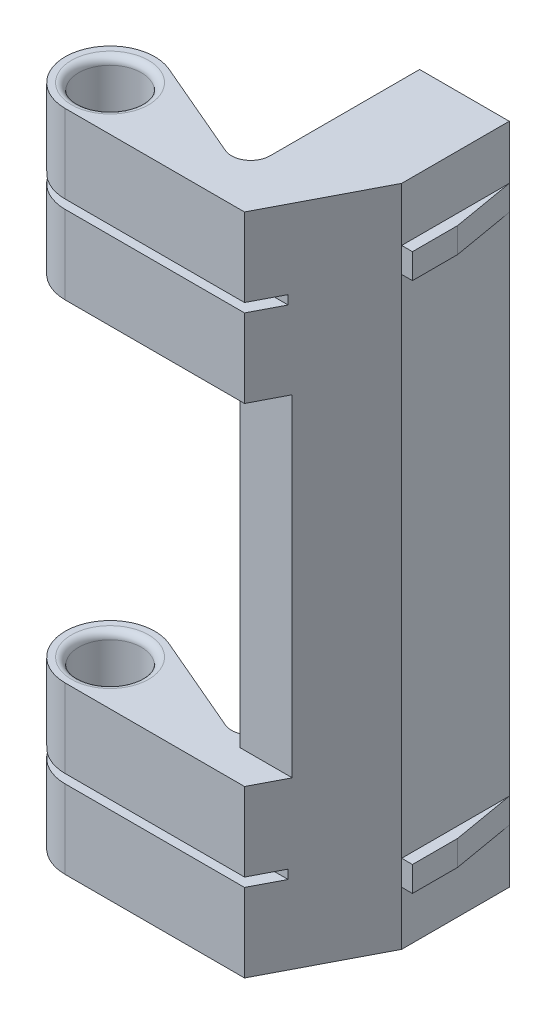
ISO-10303-21;
HEADER;
FILE_DESCRIPTION(('STEP AP214'),'2;1');
FILE_NAME('part.step','',(''),(''),'','','');
FILE_SCHEMA(('AUTOMOTIVE_DESIGN { 1 0 10303 214 1 1 1 1 }'));
ENDSEC;
DATA;
#1=APPLICATION_CONTEXT('core data for automotive mechanical design processes');
#2=APPLICATION_PROTOCOL_DEFINITION('international standard','automotive_design',2000,#1);
#3=PRODUCT_CONTEXT('',#1,'mechanical');
#4=PRODUCT('Part','Part','',(#3));
#5=PRODUCT_RELATED_PRODUCT_CATEGORY('part','',(#4));
#6=PRODUCT_DEFINITION_FORMATION('','',#4);
#7=PRODUCT_DEFINITION_CONTEXT('part definition',#1,'design');
#8=PRODUCT_DEFINITION('design','',#6,#7);
#9=PRODUCT_DEFINITION_SHAPE('','',#8);
#10=(LENGTH_UNIT() NAMED_UNIT(*) SI_UNIT(.MILLI.,.METRE.));
#11=(NAMED_UNIT(*) PLANE_ANGLE_UNIT() SI_UNIT($,.RADIAN.));
#12=(NAMED_UNIT(*) SI_UNIT($,.STERADIAN.) SOLID_ANGLE_UNIT());
#13=UNCERTAINTY_MEASURE_WITH_UNIT(LENGTH_MEASURE(1.E-05),#10,'distance_accuracy_value','');
#14=(GEOMETRIC_REPRESENTATION_CONTEXT(3) GLOBAL_UNCERTAINTY_ASSIGNED_CONTEXT((#13)) GLOBAL_UNIT_ASSIGNED_CONTEXT((#10,
#11,#12)) REPRESENTATION_CONTEXT('',''));
#15=CARTESIAN_POINT('',(0.,0.,0.));
#16=DIRECTION('',(0.,0.,1.));
#17=DIRECTION('',(1.,0.,0.));
#18=AXIS2_PLACEMENT_3D('',#15,#16,#17);
#19=CARTESIAN_POINT('',(0.,74.,0.));
#20=DIRECTION('',(0.,0.,-1.));
#21=DIRECTION('',(-1.,0.,0.));
#22=AXIS2_PLACEMENT_3D('',#19,#20,#21);
#23=PLANE('',#22);
#24=DIRECTION('',(0.,-1.,0.));
#25=VECTOR('',#24,1.);
#26=CARTESIAN_POINT('',(-20.,74.,0.));
#27=LINE('',#26,#25);
#28=CARTESIAN_POINT('',(-20.,74.,0.));
#29=VERTEX_POINT('',#28);
#30=CARTESIAN_POINT('',(-20.,65.25,0.));
#31=VERTEX_POINT('',#30);
#32=EDGE_CURVE('E694',#29,#31,#27,.T.);
#33=ORIENTED_EDGE('',*,*,#32,.T.);
#34=DIRECTION('',(-1.,0.,0.));
#35=VECTOR('',#34,1.);
#36=CARTESIAN_POINT('',(-27.3255507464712,65.25,0.));
#37=LINE('',#36,#35);
#38=CARTESIAN_POINT('',(0.,65.25,0.));
#39=VERTEX_POINT('',#38);
#40=EDGE_CURVE('E954',#39,#31,#37,.T.);
#41=ORIENTED_EDGE('',*,*,#40,.F.);
#42=DIRECTION('',(0.,-1.,0.));
#43=VECTOR('',#42,1.);
#44=CARTESIAN_POINT('',(0.,74.,0.));
#45=LINE('',#44,#43);
#46=CARTESIAN_POINT('',(0.,74.,0.));
#47=VERTEX_POINT('',#46);
#48=EDGE_CURVE('E395',#47,#39,#45,.T.);
#49=ORIENTED_EDGE('',*,*,#48,.F.);
#50=DIRECTION('',(1.,0.,0.));
#51=VECTOR('',#50,1.);
#52=CARTESIAN_POINT('',(0.,74.,0.));
#53=LINE('',#52,#51);
#54=EDGE_CURVE('E761',#29,#47,#53,.T.);
#55=ORIENTED_EDGE('',*,*,#54,.F.);
#56=EDGE_LOOP('',(#33,#41,#49,#55));
#57=FACE_BOUND('',#56,.T.);
#58=ADVANCED_FACE('F34',(#57),#23,.F.);
#59=CARTESIAN_POINT('',(-20.,0.,-5.));
#60=DIRECTION('',(0.,1.,0.));
#61=DIRECTION('',(0.,0.,1.));
#62=AXIS2_PLACEMENT_3D('',#59,#60,#61);
#63=CYLINDRICAL_SURFACE('',#62,3.5);
#64=CARTESIAN_POINT('',(-20.,73.2,-5.));
#65=DIRECTION('',(0.,1.,0.));
#66=DIRECTION('',(0.,0.,1.));
#67=AXIS2_PLACEMENT_3D('',#64,#65,#66);
#68=CIRCLE('',#67,3.5);
#69=CARTESIAN_POINT('',(-20.,73.2,-1.5));
#70=VERTEX_POINT('',#69);
#71=EDGE_CURVE('E1189',#70,#70,#68,.T.);
#72=ORIENTED_EDGE('',*,*,#71,.T.);
#73=EDGE_LOOP('',(#72));
#74=FACE_BOUND('',#73,.T.);
#75=CARTESIAN_POINT('',(-20.,56.3,-5.));
#76=DIRECTION('',(0.,1.,0.));
#77=DIRECTION('',(-1.,0.,0.));
#78=AXIS2_PLACEMENT_3D('',#75,#76,#77);
#79=CIRCLE('',#78,3.5);
#80=CARTESIAN_POINT('',(-23.5,56.3,-5.));
#81=VERTEX_POINT('',#80);
#82=EDGE_CURVE('E1197',#81,#81,#79,.F.);
#83=ORIENTED_EDGE('',*,*,#82,.T.);
#84=EDGE_LOOP('',(#83));
#85=FACE_BOUND('',#84,.T.);
#86=DIRECTION('',(0.,1.,0.));
#87=VECTOR('',#86,1.);
#88=CARTESIAN_POINT('',(-16.9983337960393,0.,-3.2));
#89=LINE('',#88,#87);
#90=CARTESIAN_POINT('',(-16.9983337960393,65.25,-3.2));
#91=VERTEX_POINT('',#90);
#92=CARTESIAN_POINT('',(-16.9983337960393,64.25,-3.2));
#93=VERTEX_POINT('',#92);
#94=EDGE_CURVE('E11',#91,#93,#89,.F.);
#95=ORIENTED_EDGE('',*,*,#94,.F.);
#96=CARTESIAN_POINT('',(-20.,65.25,-5.));
#97=DIRECTION('',(0.,1.,0.));
#98=DIRECTION('',(0.,0.,1.));
#99=AXIS2_PLACEMENT_3D('',#96,#97,#98);
#100=CIRCLE('',#99,3.5);
#101=CARTESIAN_POINT('',(-23.0016662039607,65.25,-3.2));
#102=VERTEX_POINT('',#101);
#103=EDGE_CURVE('E42',#91,#102,#100,.F.);
#104=ORIENTED_EDGE('',*,*,#103,.T.);
#105=DIRECTION('',(0.,1.,0.));
#106=VECTOR('',#105,1.);
#107=CARTESIAN_POINT('',(-23.0016662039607,0.,-3.2));
#108=LINE('',#107,#106);
#109=CARTESIAN_POINT('',(-23.0016662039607,64.25,-3.2));
#110=VERTEX_POINT('',#109);
#111=EDGE_CURVE('E946',#110,#102,#108,.T.);
#112=ORIENTED_EDGE('',*,*,#111,.F.);
#113=CARTESIAN_POINT('',(-20.,64.25,-5.));
#114=DIRECTION('',(0.,-1.,0.));
#115=DIRECTION('',(0.,0.,-1.));
#116=AXIS2_PLACEMENT_3D('',#113,#114,#115);
#117=CIRCLE('',#116,3.5);
#118=EDGE_CURVE('E948',#110,#93,#117,.F.);
#119=ORIENTED_EDGE('',*,*,#118,.T.);
#120=EDGE_LOOP('',(#95,#104,#112,#119));
#121=FACE_BOUND('',#120,.T.);
#122=ADVANCED_FACE('F854',(#74,#85,#121),#63,.F.);
#123=CARTESIAN_POINT('',(0.,8.74999999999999,0.));
#124=VERTEX_POINT('',#123);
#125=CARTESIAN_POINT('',(0.,0.,0.));
#126=VERTEX_POINT('',#125);
#127=EDGE_CURVE('E701',#124,#126,#45,.T.);
#128=ORIENTED_EDGE('',*,*,#127,.F.);
#129=DIRECTION('',(1.,0.,0.));
#130=VECTOR('',#129,1.);
#131=CARTESIAN_POINT('',(-27.3255507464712,8.74999999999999,0.));
#132=LINE('',#131,#130);
#133=CARTESIAN_POINT('',(-20.,8.74999999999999,0.));
#134=VERTEX_POINT('',#133);
#135=EDGE_CURVE('E400',#134,#124,#132,.T.);
#136=ORIENTED_EDGE('',*,*,#135,.F.);
#137=CARTESIAN_POINT('',(-20.,0.,0.));
#138=VERTEX_POINT('',#137);
#139=EDGE_CURVE('E698',#134,#138,#27,.T.);
#140=ORIENTED_EDGE('',*,*,#139,.T.);
#141=DIRECTION('',(1.,0.,0.));
#142=VECTOR('',#141,1.);
#143=CARTESIAN_POINT('',(0.,0.,0.));
#144=LINE('',#143,#142);
#145=EDGE_CURVE('E731',#138,#126,#144,.T.);
#146=ORIENTED_EDGE('',*,*,#145,.T.);
#147=EDGE_LOOP('',(#128,#136,#140,#146));
#148=FACE_BOUND('',#147,.T.);
#149=ADVANCED_FACE('F857',(#148),#23,.F.);
#150=CARTESIAN_POINT('',(-20.,17.7,-5.));
#151=DIRECTION('',(0.,-1.,0.));
#152=DIRECTION('',(1.,0.,0.));
#153=AXIS2_PLACEMENT_3D('',#150,#151,#152);
#154=CIRCLE('',#153,3.5);
#155=CARTESIAN_POINT('',(-16.5,17.7,-5.));
#156=VERTEX_POINT('',#155);
#157=EDGE_CURVE('E1181',#156,#156,#154,.F.);
#158=ORIENTED_EDGE('',*,*,#157,.T.);
#159=EDGE_LOOP('',(#158));
#160=FACE_BOUND('',#159,.T.);
#161=CARTESIAN_POINT('',(-20.,0.8,-5.));
#162=DIRECTION('',(0.,1.,0.));
#163=DIRECTION('',(0.,0.,1.));
#164=AXIS2_PLACEMENT_3D('',#161,#162,#163);
#165=CIRCLE('',#164,3.5);
#166=CARTESIAN_POINT('',(-20.,0.8,-1.5));
#167=VERTEX_POINT('',#166);
#168=EDGE_CURVE('E1184',#167,#167,#165,.F.);
#169=ORIENTED_EDGE('',*,*,#168,.T.);
#170=EDGE_LOOP('',(#169));
#171=FACE_BOUND('',#170,.T.);
#172=DIRECTION('',(0.,1.,0.));
#173=VECTOR('',#172,1.);
#174=CARTESIAN_POINT('',(-16.9983337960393,0.,-3.2));
#175=LINE('',#174,#173);
#176=CARTESIAN_POINT('',(-16.9983337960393,9.74999999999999,-3.2));
#177=VERTEX_POINT('',#176);
#178=CARTESIAN_POINT('',(-16.9983337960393,8.74999999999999,-3.2));
#179=VERTEX_POINT('',#178);
#180=EDGE_CURVE('E932',#177,#179,#175,.F.);
#181=ORIENTED_EDGE('',*,*,#180,.F.);
#182=CARTESIAN_POINT('',(-20.,9.74999999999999,-5.));
#183=DIRECTION('',(0.,1.,0.));
#184=DIRECTION('',(0.,0.,1.));
#185=AXIS2_PLACEMENT_3D('',#182,#183,#184);
#186=CIRCLE('',#185,3.5);
#187=CARTESIAN_POINT('',(-23.0016662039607,9.74999999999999,-3.2));
#188=VERTEX_POINT('',#187);
#189=EDGE_CURVE('E933',#177,#188,#186,.F.);
#190=ORIENTED_EDGE('',*,*,#189,.T.);
#191=DIRECTION('',(0.,1.,0.));
#192=VECTOR('',#191,1.);
#193=CARTESIAN_POINT('',(-23.0016662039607,0.,-3.2));
#194=LINE('',#193,#192);
#195=CARTESIAN_POINT('',(-23.0016662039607,8.74999999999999,-3.2));
#196=VERTEX_POINT('',#195);
#197=EDGE_CURVE('E936',#196,#188,#194,.T.);
#198=ORIENTED_EDGE('',*,*,#197,.F.);
#199=CARTESIAN_POINT('',(-20.,8.74999999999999,-5.));
#200=DIRECTION('',(0.,-1.,0.));
#201=DIRECTION('',(0.,0.,-1.));
#202=AXIS2_PLACEMENT_3D('',#199,#200,#201);
#203=CIRCLE('',#202,3.5);
#204=EDGE_CURVE('E927',#196,#179,#203,.F.);
#205=ORIENTED_EDGE('',*,*,#204,.T.);
#206=EDGE_LOOP('',(#181,#190,#198,#205));
#207=FACE_BOUND('',#206,.T.);
#208=ADVANCED_FACE('F864',(#160,#171,#207),#63,.F.);
#209=CARTESIAN_POINT('',(6.,74.,-23.5325625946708));
#210=DIRECTION('',(-1.,0.,0.));
#211=DIRECTION('',(0.,0.,1.));
#212=AXIS2_PLACEMENT_3D('',#209,#210,#211);
#213=PLANE('',#212);
#214=DIRECTION('',(0.,0.,-1.));
#215=VECTOR('',#214,1.);
#216=CARTESIAN_POINT('',(6.,6.00000000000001,-11.5325625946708));
#217=LINE('',#216,#215);
#218=CARTESIAN_POINT('',(6.,6.00000000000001,-11.5325625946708));
#219=VERTEX_POINT('',#218);
#220=CARTESIAN_POINT('',(6.,6.00000000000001,-23.5325625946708));
#221=VERTEX_POINT('',#220);
#222=EDGE_CURVE('E593',#219,#221,#217,.T.);
#223=ORIENTED_EDGE('',*,*,#222,.F.);
#224=DIRECTION('',(0.,-1.,0.));
#225=VECTOR('',#224,1.);
#226=CARTESIAN_POINT('',(6.,74.,-11.5325625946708));
#227=LINE('',#226,#225);
#228=CARTESIAN_POINT('',(6.,0.,-11.5325625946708));
#229=VERTEX_POINT('',#228);
#230=EDGE_CURVE('E659',#219,#229,#227,.T.);
#231=ORIENTED_EDGE('',*,*,#230,.T.);
#232=DIRECTION('',(0.,0.,-1.));
#233=VECTOR('',#232,1.);
#234=CARTESIAN_POINT('',(6.,0.,-23.5325625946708));
#235=LINE('',#234,#233);
#236=CARTESIAN_POINT('',(6.,0.,-23.5325625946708));
#237=VERTEX_POINT('',#236);
#238=EDGE_CURVE('E724',#229,#237,#235,.T.);
#239=ORIENTED_EDGE('',*,*,#238,.T.);
#240=DIRECTION('',(0.,-1.,0.));
#241=VECTOR('',#240,1.);
#242=CARTESIAN_POINT('',(6.,74.,-23.5325625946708));
#243=LINE('',#242,#241);
#244=EDGE_CURVE('E654',#221,#237,#243,.T.);
#245=ORIENTED_EDGE('',*,*,#244,.F.);
#246=EDGE_LOOP('',(#223,#231,#239,#245));
#247=FACE_BOUND('',#246,.T.);
#248=ADVANCED_FACE('F721',(#247),#213,.F.);
#249=DIRECTION('',(0.,0.,1.));
#250=VECTOR('',#249,1.);
#251=CARTESIAN_POINT('',(6.,8.8,-11.5325625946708));
#252=LINE('',#251,#250);
#253=CARTESIAN_POINT('',(6.,8.8,-23.5325625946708));
#254=VERTEX_POINT('',#253);
#255=CARTESIAN_POINT('',(6.,8.8,-11.5325625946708));
#256=VERTEX_POINT('',#255);
#257=EDGE_CURVE('E607',#254,#256,#252,.T.);
#258=ORIENTED_EDGE('',*,*,#257,.F.);
#259=CARTESIAN_POINT('',(6.,65.2,-23.5325625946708));
#260=VERTEX_POINT('',#259);
#261=EDGE_CURVE('E657',#260,#254,#243,.T.);
#262=ORIENTED_EDGE('',*,*,#261,.F.);
#263=DIRECTION('',(0.,0.,-1.));
#264=VECTOR('',#263,1.);
#265=CARTESIAN_POINT('',(6.,65.2,-11.5325625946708));
#266=LINE('',#265,#264);
#267=CARTESIAN_POINT('',(6.,65.2,-11.5325625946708));
#268=VERTEX_POINT('',#267);
#269=EDGE_CURVE('E631',#268,#260,#266,.T.);
#270=ORIENTED_EDGE('',*,*,#269,.F.);
#271=EDGE_CURVE('E635',#268,#256,#227,.T.);
#272=ORIENTED_EDGE('',*,*,#271,.T.);
#273=EDGE_LOOP('',(#258,#262,#270,#272));
#274=FACE_BOUND('',#273,.T.);
#275=ADVANCED_FACE('F1165',(#274),#213,.F.);
#276=DIRECTION('',(0.,0.,1.));
#277=VECTOR('',#276,1.);
#278=CARTESIAN_POINT('',(6.,68.,-11.5325625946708));
#279=LINE('',#278,#277);
#280=CARTESIAN_POINT('',(6.,68.,-23.5325625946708));
#281=VERTEX_POINT('',#280);
#282=CARTESIAN_POINT('',(6.,68.,-11.5325625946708));
#283=VERTEX_POINT('',#282);
#284=EDGE_CURVE('E620',#281,#283,#279,.T.);
#285=ORIENTED_EDGE('',*,*,#284,.F.);
#286=CARTESIAN_POINT('',(6.,74.,-23.5325625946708));
#287=VERTEX_POINT('',#286);
#288=EDGE_CURVE('E670',#287,#281,#243,.T.);
#289=ORIENTED_EDGE('',*,*,#288,.F.);
#290=DIRECTION('',(0.,0.,-1.));
#291=VECTOR('',#290,1.);
#292=CARTESIAN_POINT('',(6.,74.,-23.5325625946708));
#293=LINE('',#292,#291);
#294=CARTESIAN_POINT('',(6.,74.,-11.5325625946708));
#295=VERTEX_POINT('',#294);
#296=EDGE_CURVE('E757',#295,#287,#293,.T.);
#297=ORIENTED_EDGE('',*,*,#296,.F.);
#298=EDGE_CURVE('E704',#295,#283,#227,.T.);
#299=ORIENTED_EDGE('',*,*,#298,.T.);
#300=EDGE_LOOP('',(#285,#289,#297,#299));
#301=FACE_BOUND('',#300,.T.);
#302=ADVANCED_FACE('F1142',(#301),#213,.F.);
#303=CARTESIAN_POINT('',(-4.,74.,-6.85237247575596));
#304=DIRECTION('',(1.,0.,0.));
#305=DIRECTION('',(0.,0.,-1.));
#306=AXIS2_PLACEMENT_3D('',#303,#304,#305);
#307=PLANE('',#306);
#308=DIRECTION('',(0.,0.,1.));
#309=VECTOR('',#308,1.);
#310=CARTESIAN_POINT('',(-4.,25.9124094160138,-23.5325625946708));
#311=LINE('',#310,#309);
#312=CARTESIAN_POINT('',(-4.,25.9124094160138,-23.5325625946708));
#313=VERTEX_POINT('',#312);
#314=CARTESIAN_POINT('',(-4.,25.9124094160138,-15.5325625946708));
#315=VERTEX_POINT('',#314);
#316=EDGE_CURVE('E816',#313,#315,#311,.T.);
#317=ORIENTED_EDGE('',*,*,#316,.F.);
#318=DIRECTION('',(0.,-1.,0.));
#319=VECTOR('',#318,1.);
#320=CARTESIAN_POINT('',(-4.,74.,-23.5325625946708));
#321=LINE('',#320,#319);
#322=CARTESIAN_POINT('',(-4.,0.,-23.5325625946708));
#323=VERTEX_POINT('',#322);
#324=EDGE_CURVE('E756',#313,#323,#321,.T.);
#325=ORIENTED_EDGE('',*,*,#324,.T.);
#326=DIRECTION('',(0.,0.,1.));
#327=VECTOR('',#326,1.);
#328=CARTESIAN_POINT('',(-4.,0.,-6.85237247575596));
#329=LINE('',#328,#327);
#330=CARTESIAN_POINT('',(-4.,0.,-6.85237247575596));
#331=VERTEX_POINT('',#330);
#332=EDGE_CURVE('E750',#323,#331,#329,.T.);
#333=ORIENTED_EDGE('',*,*,#332,.T.);
#334=DIRECTION('',(0.,-1.,0.));
#335=VECTOR('',#334,1.);
#336=CARTESIAN_POINT('',(-4.,74.,-6.85237247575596));
#337=LINE('',#336,#335);
#338=CARTESIAN_POINT('',(-4.,18.5,-6.85237247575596));
#339=VERTEX_POINT('',#338);
#340=EDGE_CURVE('E685',#339,#331,#337,.T.);
#341=ORIENTED_EDGE('',*,*,#340,.F.);
#342=DIRECTION('',(0.,0.,1.));
#343=VECTOR('',#342,1.);
#344=CARTESIAN_POINT('',(-4.,18.5,-13.5));
#345=LINE('',#344,#343);
#346=CARTESIAN_POINT('',(-4.,18.5,-3.5));
#347=VERTEX_POINT('',#346);
#348=EDGE_CURVE('E798',#339,#347,#345,.T.);
#349=ORIENTED_EDGE('',*,*,#348,.T.);
#350=DIRECTION('',(0.,1.,0.));
#351=VECTOR('',#350,1.);
#352=CARTESIAN_POINT('',(-4.,55.5,-3.5));
#353=LINE('',#352,#351);
#354=CARTESIAN_POINT('',(-4.,55.5,-3.5));
#355=VERTEX_POINT('',#354);
#356=EDGE_CURVE('E800',#347,#355,#353,.T.);
#357=ORIENTED_EDGE('',*,*,#356,.T.);
#358=DIRECTION('',(0.,0.,1.));
#359=VECTOR('',#358,1.);
#360=CARTESIAN_POINT('',(-4.,55.5,-13.5));
#361=LINE('',#360,#359);
#362=CARTESIAN_POINT('',(-4.,55.5,-6.85237247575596));
#363=VERTEX_POINT('',#362);
#364=EDGE_CURVE('E797',#363,#355,#361,.T.);
#365=ORIENTED_EDGE('',*,*,#364,.F.);
#366=CARTESIAN_POINT('',(-4.,74.,-6.85237247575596));
#367=VERTEX_POINT('',#366);
#368=EDGE_CURVE('E682',#367,#363,#337,.T.);
#369=ORIENTED_EDGE('',*,*,#368,.F.);
#370=DIRECTION('',(0.,0.,1.));
#371=VECTOR('',#370,1.);
#372=CARTESIAN_POINT('',(-4.,74.,-6.85237247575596));
#373=LINE('',#372,#371);
#374=CARTESIAN_POINT('',(-4.,74.,-23.5325625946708));
#375=VERTEX_POINT('',#374);
#376=EDGE_CURVE('E738',#375,#367,#373,.T.);
#377=ORIENTED_EDGE('',*,*,#376,.F.);
#378=CARTESIAN_POINT('',(-4.,48.0875905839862,-23.5325625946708));
#379=VERTEX_POINT('',#378);
#380=EDGE_CURVE('E658',#375,#379,#321,.T.);
#381=ORIENTED_EDGE('',*,*,#380,.T.);
#382=DIRECTION('',(0.,0.,-1.));
#383=VECTOR('',#382,1.);
#384=CARTESIAN_POINT('',(-4.,48.0875905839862,-23.5325625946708));
#385=LINE('',#384,#383);
#386=CARTESIAN_POINT('',(-4.,48.0875905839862,-15.5325625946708));
#387=VERTEX_POINT('',#386);
#388=EDGE_CURVE('E811',#387,#379,#385,.T.);
#389=ORIENTED_EDGE('',*,*,#388,.F.);
#390=DIRECTION('',(0.,1.,0.));
#391=VECTOR('',#390,1.);
#392=CARTESIAN_POINT('',(-4.,48.0875905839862,-15.5325625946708));
#393=LINE('',#392,#391);
#394=EDGE_CURVE('E814',#315,#387,#393,.T.);
#395=ORIENTED_EDGE('',*,*,#394,.F.);
#396=EDGE_LOOP('',(#317,#325,#333,#341,#349,#357,#365,#369,#377,#381,#389,#395));
#397=FACE_BOUND('',#396,.T.);
#398=ADVANCED_FACE('F832',(#397),#307,.F.);
#399=CARTESIAN_POINT('',(-6.15312580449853,74.,-6.85237247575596));
#400=DIRECTION('',(0.,-1.,0.));
#401=DIRECTION('',(0.,0.,-1.));
#402=AXIS2_PLACEMENT_3D('',#399,#400,#401);
#403=CYLINDRICAL_SURFACE('',#402,2.15312580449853);
#404=ORIENTED_EDGE('',*,*,#368,.T.);
#405=CARTESIAN_POINT('',(-6.15312580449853,55.5,-6.85237247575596));
#406=DIRECTION('',(0.,1.,0.));
#407=DIRECTION('',(0.,0.,1.));
#408=AXIS2_PLACEMENT_3D('',#405,#406,#407);
#409=CIRCLE('',#408,2.15312580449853);
#410=CARTESIAN_POINT('',(-7.00061984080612,55.5,-4.87305325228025));
#411=VERTEX_POINT('',#410);
#412=EDGE_CURVE('E782',#363,#411,#409,.F.);
#413=ORIENTED_EDGE('',*,*,#412,.T.);
#414=DIRECTION('',(0.,-1.,0.));
#415=VECTOR('',#414,1.);
#416=CARTESIAN_POINT('',(-7.00061984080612,74.,-4.87305325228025));
#417=LINE('',#416,#415);
#418=CARTESIAN_POINT('',(-7.00061984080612,74.,-4.87305325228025));
#419=VERTEX_POINT('',#418);
#420=EDGE_CURVE('E686',#419,#411,#417,.T.);
#421=ORIENTED_EDGE('',*,*,#420,.F.);
#422=CARTESIAN_POINT('',(-6.15312580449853,74.,-6.85237247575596));
#423=DIRECTION('',(0.,-1.,0.));
#424=DIRECTION('',(0.,0.,-1.));
#425=AXIS2_PLACEMENT_3D('',#422,#423,#424);
#426=CIRCLE('',#425,2.15312580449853);
#427=EDGE_CURVE('E767',#367,#419,#426,.T.);
#428=ORIENTED_EDGE('',*,*,#427,.F.);
#429=EDGE_LOOP('',(#404,#413,#421,#428));
#430=FACE_BOUND('',#429,.T.);
#431=ADVANCED_FACE('F890',(#430),#403,.F.);
#432=CARTESIAN_POINT('',(-18.0319449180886,74.,-9.59638544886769));
#433=DIRECTION('',(-0.393611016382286,0.,0.919277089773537));
#434=DIRECTION('',(0.919277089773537,0.,0.393611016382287));
#435=AXIS2_PLACEMENT_3D('',#432,#433,#434);
#436=PLANE('',#435);
#437=ORIENTED_EDGE('',*,*,#420,.T.);
#438=DIRECTION('',(-0.919277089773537,0.,-0.393611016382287));
#439=VECTOR('',#438,1.);
#440=CARTESIAN_POINT('',(-18.0319449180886,55.5,-9.59638544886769));
#441=LINE('',#440,#439);
#442=CARTESIAN_POINT('',(-18.0319449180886,55.5,-9.59638544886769));
#443=VERTEX_POINT('',#442);
#444=EDGE_CURVE('E788',#411,#443,#441,.T.);
#445=ORIENTED_EDGE('',*,*,#444,.T.);
#446=DIRECTION('',(0.,-1.,0.));
#447=VECTOR('',#446,1.);
#448=CARTESIAN_POINT('',(-18.0319449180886,74.,-9.59638544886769));
#449=LINE('',#448,#447);
#450=CARTESIAN_POINT('',(-18.0319449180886,74.,-9.59638544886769));
#451=VERTEX_POINT('',#450);
#452=EDGE_CURVE('E690',#451,#443,#449,.T.);
#453=ORIENTED_EDGE('',*,*,#452,.F.);
#454=DIRECTION('',(-0.919277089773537,0.,-0.393611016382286));
#455=VECTOR('',#454,1.);
#456=CARTESIAN_POINT('',(-18.0319449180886,74.,-9.59638544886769));
#457=LINE('',#456,#455);
#458=EDGE_CURVE('E765',#419,#451,#457,.T.);
#459=ORIENTED_EDGE('',*,*,#458,.F.);
#460=EDGE_LOOP('',(#437,#445,#453,#459));
#461=FACE_BOUND('',#460,.T.);
#462=ADVANCED_FACE('F891',(#461),#436,.F.);
#463=CARTESIAN_POINT('',(-20.,74.,-5.));
#464=DIRECTION('',(0.,-1.,0.));
#465=DIRECTION('',(0.,0.,-1.));
#466=AXIS2_PLACEMENT_3D('',#463,#464,#465);
#467=CYLINDRICAL_SURFACE('',#466,5.);
#468=DIRECTION('',(0.,-1.,0.));
#469=VECTOR('',#468,1.);
#470=CARTESIAN_POINT('',(-24.6647615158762,74.,-3.2));
#471=LINE('',#470,#469);
#472=CARTESIAN_POINT('',(-24.6647615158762,65.25,-3.2));
#473=VERTEX_POINT('',#472);
#474=CARTESIAN_POINT('',(-24.6647615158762,64.25,-3.2));
#475=VERTEX_POINT('',#474);
#476=EDGE_CURVE('E381',#473,#475,#471,.T.);
#477=ORIENTED_EDGE('',*,*,#476,.F.);
#478=CARTESIAN_POINT('',(-20.,65.25,-5.));
#479=DIRECTION('',(0.,1.,0.));
#480=DIRECTION('',(0.,0.,1.));
#481=AXIS2_PLACEMENT_3D('',#478,#479,#480);
#482=CIRCLE('',#481,5.);
#483=EDGE_CURVE('E396',#473,#31,#482,.T.);
#484=ORIENTED_EDGE('',*,*,#483,.T.);
#485=ORIENTED_EDGE('',*,*,#32,.F.);
#486=CARTESIAN_POINT('',(-20.,74.,-5.));
#487=DIRECTION('',(0.,1.,0.));
#488=DIRECTION('',(0.,0.,1.));
#489=AXIS2_PLACEMENT_3D('',#486,#487,#488);
#490=CIRCLE('',#489,5.);
#491=EDGE_CURVE('E763',#451,#29,#490,.T.);
#492=ORIENTED_EDGE('',*,*,#491,.F.);
#493=ORIENTED_EDGE('',*,*,#452,.T.);
#494=CARTESIAN_POINT('',(-20.,55.5,-5.));
#495=DIRECTION('',(0.,1.,0.));
#496=DIRECTION('',(-1.,0.,0.));
#497=AXIS2_PLACEMENT_3D('',#494,#495,#496);
#498=CIRCLE('',#497,5.);
#499=CARTESIAN_POINT('',(-20.,55.5,0.));
#500=VERTEX_POINT('',#499);
#501=EDGE_CURVE('E753',#443,#500,#498,.T.);
#502=ORIENTED_EDGE('',*,*,#501,.T.);
#503=CARTESIAN_POINT('',(-20.,64.25,0.));
#504=VERTEX_POINT('',#503);
#505=EDGE_CURVE('E696',#504,#500,#27,.T.);
#506=ORIENTED_EDGE('',*,*,#505,.F.);
#507=CARTESIAN_POINT('',(-20.,64.25,-5.));
#508=DIRECTION('',(0.,-1.,0.));
#509=DIRECTION('',(0.,0.,-1.));
#510=AXIS2_PLACEMENT_3D('',#507,#508,#509);
#511=CIRCLE('',#510,5.);
#512=EDGE_CURVE('E397',#504,#475,#511,.T.);
#513=ORIENTED_EDGE('',*,*,#512,.T.);
#514=EDGE_LOOP('',(#477,#484,#485,#492,#493,#502,#506,#513));
#515=FACE_BOUND('',#514,.T.);
#516=ADVANCED_FACE('F879',(#515),#467,.T.);
#517=CARTESIAN_POINT('',(0.,64.25,0.));
#518=VERTEX_POINT('',#517);
#519=CARTESIAN_POINT('',(0.,55.5,0.));
#520=VERTEX_POINT('',#519);
#521=EDGE_CURVE('E699',#518,#520,#45,.T.);
#522=ORIENTED_EDGE('',*,*,#521,.F.);
#523=DIRECTION('',(1.,0.,0.));
#524=VECTOR('',#523,1.);
#525=CARTESIAN_POINT('',(-27.3255507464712,64.25,0.));
#526=LINE('',#525,#524);
#527=EDGE_CURVE('E896',#504,#518,#526,.T.);
#528=ORIENTED_EDGE('',*,*,#527,.F.);
#529=ORIENTED_EDGE('',*,*,#505,.T.);
#530=DIRECTION('',(-1.,0.,0.));
#531=VECTOR('',#530,1.);
#532=CARTESIAN_POINT('',(-45.8028555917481,55.5,0.));
#533=LINE('',#532,#531);
#534=EDGE_CURVE('E776',#520,#500,#533,.T.);
#535=ORIENTED_EDGE('',*,*,#534,.F.);
#536=EDGE_LOOP('',(#522,#528,#529,#535));
#537=FACE_BOUND('',#536,.T.);
#538=ADVANCED_FACE('F869',(#537),#23,.F.);
#539=CARTESIAN_POINT('',(-7.00061984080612,18.5,-4.87305325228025));
#540=VERTEX_POINT('',#539);
#541=CARTESIAN_POINT('',(-7.00061984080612,0.,-4.87305325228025));
#542=VERTEX_POINT('',#541);
#543=EDGE_CURVE('E689',#540,#542,#417,.T.);
#544=ORIENTED_EDGE('',*,*,#543,.F.);
#545=CARTESIAN_POINT('',(-6.15312580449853,18.5,-6.85237247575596));
#546=DIRECTION('',(0.,-1.,0.));
#547=DIRECTION('',(0.,0.,-1.));
#548=AXIS2_PLACEMENT_3D('',#545,#546,#547);
#549=CIRCLE('',#548,2.15312580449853);
#550=EDGE_CURVE('E791',#540,#339,#549,.F.);
#551=ORIENTED_EDGE('',*,*,#550,.T.);
#552=ORIENTED_EDGE('',*,*,#340,.T.);
#553=CARTESIAN_POINT('',(-6.15312580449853,0.,-6.85237247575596));
#554=DIRECTION('',(0.,-1.,0.));
#555=DIRECTION('',(0.,0.,-1.));
#556=AXIS2_PLACEMENT_3D('',#553,#554,#555);
#557=CIRCLE('',#556,2.15312580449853);
#558=EDGE_CURVE('E747',#331,#542,#557,.T.);
#559=ORIENTED_EDGE('',*,*,#558,.T.);
#560=EDGE_LOOP('',(#544,#551,#552,#559));
#561=FACE_BOUND('',#560,.T.);
#562=ADVANCED_FACE('F882',(#561),#403,.F.);
#563=CARTESIAN_POINT('',(-18.0319449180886,18.5,-9.59638544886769));
#564=VERTEX_POINT('',#563);
#565=CARTESIAN_POINT('',(-18.0319449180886,0.,-9.59638544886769));
#566=VERTEX_POINT('',#565);
#567=EDGE_CURVE('E693',#564,#566,#449,.T.);
#568=ORIENTED_EDGE('',*,*,#567,.F.);
#569=DIRECTION('',(0.919277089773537,0.,0.393611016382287));
#570=VECTOR('',#569,1.);
#571=CARTESIAN_POINT('',(-18.0319449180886,18.5,-9.59638544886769));
#572=LINE('',#571,#570);
#573=EDGE_CURVE('E794',#564,#540,#572,.T.);
#574=ORIENTED_EDGE('',*,*,#573,.T.);
#575=ORIENTED_EDGE('',*,*,#543,.T.);
#576=DIRECTION('',(-0.919277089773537,0.,-0.393611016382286));
#577=VECTOR('',#576,1.);
#578=CARTESIAN_POINT('',(-18.0319449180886,0.,-9.59638544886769));
#579=LINE('',#578,#577);
#580=EDGE_CURVE('E744',#542,#566,#579,.T.);
#581=ORIENTED_EDGE('',*,*,#580,.T.);
#582=EDGE_LOOP('',(#568,#574,#575,#581));
#583=FACE_BOUND('',#582,.T.);
#584=ADVANCED_FACE('F877',(#583),#436,.F.);
#585=ORIENTED_EDGE('',*,*,#139,.F.);
#586=CARTESIAN_POINT('',(-20.,8.74999999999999,-5.));
#587=DIRECTION('',(0.,-1.,0.));
#588=DIRECTION('',(0.,0.,-1.));
#589=AXIS2_PLACEMENT_3D('',#586,#587,#588);
#590=CIRCLE('',#589,5.);
#591=CARTESIAN_POINT('',(-24.6647615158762,8.74999999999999,-3.2));
#592=VERTEX_POINT('',#591);
#593=EDGE_CURVE('E430',#134,#592,#590,.T.);
#594=ORIENTED_EDGE('',*,*,#593,.T.);
#595=DIRECTION('',(0.,-1.,0.));
#596=VECTOR('',#595,1.);
#597=CARTESIAN_POINT('',(-24.6647615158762,74.,-3.2));
#598=LINE('',#597,#596);
#599=CARTESIAN_POINT('',(-24.6647615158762,9.74999999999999,-3.2));
#600=VERTEX_POINT('',#599);
#601=EDGE_CURVE('E419',#600,#592,#598,.T.);
#602=ORIENTED_EDGE('',*,*,#601,.F.);
#603=CARTESIAN_POINT('',(-20.,9.74999999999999,-5.));
#604=DIRECTION('',(0.,1.,0.));
#605=DIRECTION('',(0.,0.,1.));
#606=AXIS2_PLACEMENT_3D('',#603,#604,#605);
#607=CIRCLE('',#606,5.);
#608=CARTESIAN_POINT('',(-20.,9.74999999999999,0.));
#609=VERTEX_POINT('',#608);
#610=EDGE_CURVE('E424',#600,#609,#607,.T.);
#611=ORIENTED_EDGE('',*,*,#610,.T.);
#612=CARTESIAN_POINT('',(-20.,18.5,0.));
#613=VERTEX_POINT('',#612);
#614=EDGE_CURVE('E697',#613,#609,#27,.T.);
#615=ORIENTED_EDGE('',*,*,#614,.F.);
#616=CARTESIAN_POINT('',(-20.,18.5,-5.));
#617=DIRECTION('',(0.,-1.,0.));
#618=DIRECTION('',(1.,0.,0.));
#619=AXIS2_PLACEMENT_3D('',#616,#617,#618);
#620=CIRCLE('',#619,5.);
#621=EDGE_CURVE('E773',#613,#564,#620,.T.);
#622=ORIENTED_EDGE('',*,*,#621,.T.);
#623=ORIENTED_EDGE('',*,*,#567,.T.);
#624=CARTESIAN_POINT('',(-20.,0.,-5.));
#625=DIRECTION('',(0.,1.,0.));
#626=DIRECTION('',(0.,0.,1.));
#627=AXIS2_PLACEMENT_3D('',#624,#625,#626);
#628=CIRCLE('',#627,5.);
#629=EDGE_CURVE('E741',#566,#138,#628,.T.);
#630=ORIENTED_EDGE('',*,*,#629,.T.);
#631=EDGE_LOOP('',(#585,#594,#602,#611,#615,#622,#623,#630));
#632=FACE_BOUND('',#631,.T.);
#633=ADVANCED_FACE('F871',(#632),#467,.T.);
#634=ORIENTED_EDGE('',*,*,#614,.T.);
#635=DIRECTION('',(-1.,0.,0.));
#636=VECTOR('',#635,1.);
#637=CARTESIAN_POINT('',(-27.3255507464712,9.74999999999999,0.));
#638=LINE('',#637,#636);
#639=CARTESIAN_POINT('',(0.,9.74999999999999,0.));
#640=VERTEX_POINT('',#639);
#641=EDGE_CURVE('E410',#640,#609,#638,.T.);
#642=ORIENTED_EDGE('',*,*,#641,.F.);
#643=CARTESIAN_POINT('',(0.,18.5,0.));
#644=VERTEX_POINT('',#643);
#645=EDGE_CURVE('E700',#644,#640,#45,.T.);
#646=ORIENTED_EDGE('',*,*,#645,.F.);
#647=DIRECTION('',(1.,0.,0.));
#648=VECTOR('',#647,1.);
#649=CARTESIAN_POINT('',(-45.8028555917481,18.5,0.));
#650=LINE('',#649,#648);
#651=EDGE_CURVE('E780',#613,#644,#650,.T.);
#652=ORIENTED_EDGE('',*,*,#651,.F.);
#653=EDGE_LOOP('',(#634,#642,#646,#652));
#654=FACE_BOUND('',#653,.T.);
#655=ADVANCED_FACE('F858',(#654),#23,.F.);
#656=CARTESIAN_POINT('',(6.,74.,-11.5325625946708));
#657=DIRECTION('',(-0.887120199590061,0.,-0.461538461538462));
#658=DIRECTION('',(-0.461538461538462,0.,0.887120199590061));
#659=AXIS2_PLACEMENT_3D('',#656,#657,#658);
#660=PLANE('',#659);
#661=ORIENTED_EDGE('',*,*,#48,.T.);
#662=DIRECTION('',(0.461538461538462,0.,-0.887120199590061));
#663=VECTOR('',#662,1.);
#664=CARTESIAN_POINT('',(6.,65.25,-11.5325625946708));
#665=LINE('',#664,#663);
#666=CARTESIAN_POINT('',(1.6648511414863,65.25,-3.2));
#667=VERTEX_POINT('',#666);
#668=EDGE_CURVE('E386',#39,#667,#665,.T.);
#669=ORIENTED_EDGE('',*,*,#668,.T.);
#670=DIRECTION('',(0.,1.,0.));
#671=VECTOR('',#670,1.);
#672=CARTESIAN_POINT('',(1.66485114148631,74.,-3.2));
#673=LINE('',#672,#671);
#674=CARTESIAN_POINT('',(1.66485114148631,64.25,-3.2));
#675=VERTEX_POINT('',#674);
#676=EDGE_CURVE('E373',#675,#667,#673,.T.);
#677=ORIENTED_EDGE('',*,*,#676,.F.);
#678=DIRECTION('',(-0.461538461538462,0.,0.887120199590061));
#679=VECTOR('',#678,1.);
#680=CARTESIAN_POINT('',(6.,64.25,-11.5325625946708));
#681=LINE('',#680,#679);
#682=EDGE_CURVE('E403',#675,#518,#681,.T.);
#683=ORIENTED_EDGE('',*,*,#682,.T.);
#684=ORIENTED_EDGE('',*,*,#521,.T.);
#685=DIRECTION('',(0.461538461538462,0.,-0.887120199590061));
#686=VECTOR('',#685,1.);
#687=CARTESIAN_POINT('',(6.,55.5,-11.5325625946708));
#688=LINE('',#687,#686);
#689=CARTESIAN_POINT('',(1.82093093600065,55.5,-3.5));
#690=VERTEX_POINT('',#689);
#691=EDGE_CURVE('E673',#520,#690,#688,.T.);
#692=ORIENTED_EDGE('',*,*,#691,.T.);
#693=DIRECTION('',(0.,1.,0.));
#694=VECTOR('',#693,1.);
#695=CARTESIAN_POINT('',(1.82093093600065,74.,-3.5));
#696=LINE('',#695,#694);
#697=CARTESIAN_POINT('',(1.82093093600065,18.5,-3.5));
#698=VERTEX_POINT('',#697);
#699=EDGE_CURVE('E680',#698,#690,#696,.T.);
#700=ORIENTED_EDGE('',*,*,#699,.F.);
#701=DIRECTION('',(-0.461538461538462,0.,0.887120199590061));
#702=VECTOR('',#701,1.);
#703=CARTESIAN_POINT('',(6.,18.5,-11.5325625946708));
#704=LINE('',#703,#702);
#705=EDGE_CURVE('E677',#698,#644,#704,.T.);
#706=ORIENTED_EDGE('',*,*,#705,.T.);
#707=ORIENTED_EDGE('',*,*,#645,.T.);
#708=DIRECTION('',(0.461538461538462,0.,-0.887120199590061));
#709=VECTOR('',#708,1.);
#710=CARTESIAN_POINT('',(6.,9.74999999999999,-11.5325625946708));
#711=LINE('',#710,#709);
#712=CARTESIAN_POINT('',(1.6648511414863,9.74999999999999,-3.2));
#713=VERTEX_POINT('',#712);
#714=EDGE_CURVE('E421',#640,#713,#711,.T.);
#715=ORIENTED_EDGE('',*,*,#714,.T.);
#716=DIRECTION('',(0.,1.,0.));
#717=VECTOR('',#716,1.);
#718=CARTESIAN_POINT('',(1.66485114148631,74.,-3.2));
#719=LINE('',#718,#717);
#720=CARTESIAN_POINT('',(1.66485114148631,8.74999999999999,-3.2));
#721=VERTEX_POINT('',#720);
#722=EDGE_CURVE('E417',#721,#713,#719,.T.);
#723=ORIENTED_EDGE('',*,*,#722,.F.);
#724=DIRECTION('',(-0.461538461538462,0.,0.887120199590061));
#725=VECTOR('',#724,1.);
#726=CARTESIAN_POINT('',(6.,8.74999999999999,-11.5325625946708));
#727=LINE('',#726,#725);
#728=EDGE_CURVE('E427',#721,#124,#727,.T.);
#729=ORIENTED_EDGE('',*,*,#728,.T.);
#730=ORIENTED_EDGE('',*,*,#127,.T.);
#731=DIRECTION('',(0.461538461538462,0.,-0.887120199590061));
#732=VECTOR('',#731,1.);
#733=CARTESIAN_POINT('',(6.,0.,-11.5325625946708));
#734=LINE('',#733,#732);
#735=EDGE_CURVE('E728',#126,#229,#734,.T.);
#736=ORIENTED_EDGE('',*,*,#735,.T.);
#737=ORIENTED_EDGE('',*,*,#230,.F.);
#738=DIRECTION('',(0.,-1.,0.));
#739=VECTOR('',#738,1.);
#740=CARTESIAN_POINT('',(6.,6.00000000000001,-11.5325625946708));
#741=LINE('',#740,#739);
#742=EDGE_CURVE('E600',#256,#219,#741,.T.);
#743=ORIENTED_EDGE('',*,*,#742,.F.);
#744=ORIENTED_EDGE('',*,*,#271,.F.);
#745=DIRECTION('',(0.,-1.,0.));
#746=VECTOR('',#745,1.);
#747=CARTESIAN_POINT('',(6.,68.,-11.5325625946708));
#748=LINE('',#747,#746);
#749=EDGE_CURVE('E615',#283,#268,#748,.T.);
#750=ORIENTED_EDGE('',*,*,#749,.F.);
#751=ORIENTED_EDGE('',*,*,#298,.F.);
#752=DIRECTION('',(0.461538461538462,0.,-0.887120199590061));
#753=VECTOR('',#752,1.);
#754=CARTESIAN_POINT('',(6.,74.,-11.5325625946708));
#755=LINE('',#754,#753);
#756=EDGE_CURVE('E759',#47,#295,#755,.T.);
#757=ORIENTED_EDGE('',*,*,#756,.F.);
#758=EDGE_LOOP('',(#661,#669,#677,#683,#684,#692,#700,#706,#707,#715,#723,#729,#730,#736,#737,
#743,#744,#750,#751,#757));
#759=FACE_BOUND('',#758,.T.);
#760=ADVANCED_FACE('F392',(#759),#660,.F.);
#761=CARTESIAN_POINT('',(-4.,74.,-23.5325625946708));
#762=DIRECTION('',(0.,0.,1.));
#763=DIRECTION('',(1.,0.,0.));
#764=AXIS2_PLACEMENT_3D('',#761,#762,#763);
#765=PLANE('',#764);
#766=CARTESIAN_POINT('',(1.,12.,-23.5325625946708));
#767=DIRECTION('',(0.,0.,1.));
#768=DIRECTION('',(1.,0.,0.));
#769=AXIS2_PLACEMENT_3D('',#766,#767,#768);
#770=CIRCLE('',#769,4.);
#771=CARTESIAN_POINT('',(5.,12.,-23.5325625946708));
#772=VERTEX_POINT('',#771);
#773=EDGE_CURVE('E1720',#772,#772,#770,.T.);
#774=ORIENTED_EDGE('',*,*,#773,.T.);
#775=EDGE_LOOP('',(#774));
#776=FACE_BOUND('',#775,.T.);
#777=CARTESIAN_POINT('',(1.,37.,-23.5325625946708));
#778=DIRECTION('',(0.,0.,1.));
#779=DIRECTION('',(1.,0.,0.));
#780=AXIS2_PLACEMENT_3D('',#777,#778,#779);
#781=CIRCLE('',#780,4.);
#782=CARTESIAN_POINT('',(5.,37.,-23.5325625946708));
#783=VERTEX_POINT('',#782);
#784=EDGE_CURVE('E1717',#783,#783,#781,.T.);
#785=ORIENTED_EDGE('',*,*,#784,.T.);
#786=EDGE_LOOP('',(#785));
#787=FACE_BOUND('',#786,.T.);
#788=CARTESIAN_POINT('',(1.,62.,-23.5325625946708));
#789=DIRECTION('',(0.,0.,1.));
#790=DIRECTION('',(1.,0.,0.));
#791=AXIS2_PLACEMENT_3D('',#788,#789,#790);
#792=CIRCLE('',#791,4.);
#793=CARTESIAN_POINT('',(5.,62.,-23.5325625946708));
#794=VERTEX_POINT('',#793);
#795=EDGE_CURVE('E1712',#794,#794,#792,.T.);
#796=ORIENTED_EDGE('',*,*,#795,.T.);
#797=EDGE_LOOP('',(#796));
#798=FACE_BOUND('',#797,.T.);
#799=DIRECTION('',(0.,1.,0.));
#800=VECTOR('',#799,1.);
#801=CARTESIAN_POINT('',(-3.,59.9384471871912,-23.5325625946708));
#802=LINE('',#801,#800);
#803=CARTESIAN_POINT('',(-3.,40.3226495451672,-23.5325625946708));
#804=VERTEX_POINT('',#803);
#805=CARTESIAN_POINT('',(-3.,59.9384471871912,-23.5325625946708));
#806=VERTEX_POINT('',#805);
#807=EDGE_CURVE('E449',#804,#806,#802,.T.);
#808=ORIENTED_EDGE('',*,*,#807,.F.);
#809=CARTESIAN_POINT('',(1.,37.,-23.5325625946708));
#810=DIRECTION('',(0.,0.,1.));
#811=DIRECTION('',(-1.,0.,0.));
#812=AXIS2_PLACEMENT_3D('',#809,#810,#811);
#813=CIRCLE('',#812,5.2);
#814=CARTESIAN_POINT('',(5.,40.3226495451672,-23.5325625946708));
#815=VERTEX_POINT('',#814);
#816=EDGE_CURVE('E433',#815,#804,#813,.T.);
#817=ORIENTED_EDGE('',*,*,#816,.F.);
#818=DIRECTION('',(0.,-1.,0.));
#819=VECTOR('',#818,1.);
#820=CARTESIAN_POINT('',(5.,59.9384471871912,-23.5325625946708));
#821=LINE('',#820,#819);
#822=CARTESIAN_POINT('',(5.,59.9384471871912,-23.5325625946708));
#823=VERTEX_POINT('',#822);
#824=EDGE_CURVE('E438',#823,#815,#821,.T.);
#825=ORIENTED_EDGE('',*,*,#824,.F.);
#826=CARTESIAN_POINT('',(1.,62.,-23.5325625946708));
#827=DIRECTION('',(0.,0.,1.));
#828=DIRECTION('',(-1.,0.,0.));
#829=AXIS2_PLACEMENT_3D('',#826,#827,#828);
#830=CIRCLE('',#829,4.5);
#831=EDGE_CURVE('E452',#806,#823,#830,.T.);
#832=ORIENTED_EDGE('',*,*,#831,.F.);
#833=EDGE_LOOP('',(#808,#817,#825,#832));
#834=FACE_BOUND('',#833,.T.);
#835=DIRECTION('',(0.,1.,0.));
#836=VECTOR('',#835,1.);
#837=CARTESIAN_POINT('',(-3.,33.6773504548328,-23.5325625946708));
#838=LINE('',#837,#836);
#839=CARTESIAN_POINT('',(-3.00000000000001,14.0615528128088,-23.5325625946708));
#840=VERTEX_POINT('',#839);
#841=CARTESIAN_POINT('',(-3.,33.6773504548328,-23.5325625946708));
#842=VERTEX_POINT('',#841);
#843=EDGE_CURVE('E481',#840,#842,#838,.T.);
#844=ORIENTED_EDGE('',*,*,#843,.F.);
#845=CARTESIAN_POINT('',(1.,12.,-23.5325625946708));
#846=DIRECTION('',(0.,0.,1.));
#847=DIRECTION('',(-1.,0.,0.));
#848=AXIS2_PLACEMENT_3D('',#845,#846,#847);
#849=CIRCLE('',#848,4.5);
#850=CARTESIAN_POINT('',(4.99999999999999,14.0615528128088,-23.5325625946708));
#851=VERTEX_POINT('',#850);
#852=EDGE_CURVE('E459',#851,#840,#849,.T.);
#853=ORIENTED_EDGE('',*,*,#852,.F.);
#854=DIRECTION('',(0.,-1.,0.));
#855=VECTOR('',#854,1.);
#856=CARTESIAN_POINT('',(5.,33.6773504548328,-23.5325625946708));
#857=LINE('',#856,#855);
#858=CARTESIAN_POINT('',(5.,33.6773504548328,-23.5325625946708));
#859=VERTEX_POINT('',#858);
#860=EDGE_CURVE('E470',#859,#851,#857,.T.);
#861=ORIENTED_EDGE('',*,*,#860,.F.);
#862=CARTESIAN_POINT('',(1.,37.,-23.5325625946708));
#863=DIRECTION('',(0.,0.,1.));
#864=DIRECTION('',(-1.,0.,0.));
#865=AXIS2_PLACEMENT_3D('',#862,#863,#864);
#866=CIRCLE('',#865,5.2);
#867=EDGE_CURVE('E484',#842,#859,#866,.T.);
#868=ORIENTED_EDGE('',*,*,#867,.F.);
#869=EDGE_LOOP('',(#844,#853,#861,#868));
#870=FACE_BOUND('',#869,.T.);
#871=CARTESIAN_POINT('',(1.,12.,-23.5325625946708));
#872=DIRECTION('',(0.,0.,1.));
#873=DIRECTION('',(-1.,0.,0.));
#874=AXIS2_PLACEMENT_3D('',#871,#872,#873);
#875=CIRCLE('',#874,4.5);
#876=CARTESIAN_POINT('',(-3.00000000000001,9.93844718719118,-23.5325625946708));
#877=VERTEX_POINT('',#876);
#878=CARTESIAN_POINT('',(4.99999999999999,9.93844718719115,-23.5325625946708));
#879=VERTEX_POINT('',#878);
#880=EDGE_CURVE('E513',#877,#879,#875,.T.);
#881=ORIENTED_EDGE('',*,*,#880,.F.);
#882=DIRECTION('',(0.,1.,0.));
#883=VECTOR('',#882,1.);
#884=CARTESIAN_POINT('',(-3.00000000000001,9.93844718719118,-23.5325625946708));
#885=LINE('',#884,#883);
#886=CARTESIAN_POINT('',(-3.00000000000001,1.,-23.5325625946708));
#887=VERTEX_POINT('',#886);
#888=EDGE_CURVE('E491',#887,#877,#885,.T.);
#889=ORIENTED_EDGE('',*,*,#888,.F.);
#890=DIRECTION('',(-1.,0.,0.));
#891=VECTOR('',#890,1.);
#892=CARTESIAN_POINT('',(4.99999999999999,1.,-23.5325625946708));
#893=LINE('',#892,#891);
#894=CARTESIAN_POINT('',(4.99999999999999,1.,-23.5325625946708));
#895=VERTEX_POINT('',#894);
#896=EDGE_CURVE('E502',#895,#887,#893,.T.);
#897=ORIENTED_EDGE('',*,*,#896,.F.);
#898=DIRECTION('',(0.,-1.,0.));
#899=VECTOR('',#898,1.);
#900=CARTESIAN_POINT('',(4.99999999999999,9.93844718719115,-23.5325625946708));
#901=LINE('',#900,#899);
#902=EDGE_CURVE('E516',#879,#895,#901,.T.);
#903=ORIENTED_EDGE('',*,*,#902,.F.);
#904=EDGE_LOOP('',(#881,#889,#897,#903));
#905=FACE_BOUND('',#904,.T.);
#906=CARTESIAN_POINT('',(1.,62.,-23.5325625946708));
#907=DIRECTION('',(0.,0.,1.));
#908=DIRECTION('',(-1.,0.,0.));
#909=AXIS2_PLACEMENT_3D('',#906,#907,#908);
#910=CIRCLE('',#909,4.5);
#911=CARTESIAN_POINT('',(5.,64.0615528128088,-23.5325625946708));
#912=VERTEX_POINT('',#911);
#913=CARTESIAN_POINT('',(-3.,64.0615528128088,-23.5325625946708));
#914=VERTEX_POINT('',#913);
#915=EDGE_CURVE('E545',#912,#914,#910,.T.);
#916=ORIENTED_EDGE('',*,*,#915,.F.);
#917=DIRECTION('',(0.,-1.,0.));
#918=VECTOR('',#917,1.);
#919=CARTESIAN_POINT('',(5.,73.,-23.5325625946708));
#920=LINE('',#919,#918);
#921=CARTESIAN_POINT('',(5.,73.,-23.5325625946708));
#922=VERTEX_POINT('',#921);
#923=EDGE_CURVE('E523',#922,#912,#920,.T.);
#924=ORIENTED_EDGE('',*,*,#923,.F.);
#925=DIRECTION('',(1.,0.,0.));
#926=VECTOR('',#925,1.);
#927=CARTESIAN_POINT('',(5.,73.,-23.5325625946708));
#928=LINE('',#927,#926);
#929=CARTESIAN_POINT('',(-3.,73.,-23.5325625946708));
#930=VERTEX_POINT('',#929);
#931=EDGE_CURVE('E534',#930,#922,#928,.T.);
#932=ORIENTED_EDGE('',*,*,#931,.F.);
#933=DIRECTION('',(0.,1.,0.));
#934=VECTOR('',#933,1.);
#935=CARTESIAN_POINT('',(-3.,73.,-23.5325625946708));
#936=LINE('',#935,#934);
#937=EDGE_CURVE('E548',#914,#930,#936,.T.);
#938=ORIENTED_EDGE('',*,*,#937,.F.);
#939=EDGE_LOOP('',(#916,#924,#932,#938));
#940=FACE_BOUND('',#939,.T.);
#941=ORIENTED_EDGE('',*,*,#288,.T.);
#942=DIRECTION('',(0.,-1.,0.));
#943=VECTOR('',#942,1.);
#944=CARTESIAN_POINT('',(6.,74.000025,-23.5325625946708));
#945=LINE('',#944,#943);
#946=EDGE_CURVE('E577',#281,#260,#945,.T.);
#947=ORIENTED_EDGE('',*,*,#946,.T.);
#948=ORIENTED_EDGE('',*,*,#261,.T.);
#949=EDGE_CURVE('E579',#254,#221,#945,.T.);
#950=ORIENTED_EDGE('',*,*,#949,.T.);
#951=ORIENTED_EDGE('',*,*,#244,.T.);
#952=DIRECTION('',(-1.,0.,0.));
#953=VECTOR('',#952,1.);
#954=CARTESIAN_POINT('',(-4.,0.,-23.5325625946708));
#955=LINE('',#954,#953);
#956=EDGE_CURVE('E736',#237,#323,#955,.T.);
#957=ORIENTED_EDGE('',*,*,#956,.T.);
#958=ORIENTED_EDGE('',*,*,#324,.F.);
#959=DIRECTION('',(1.,0.,0.));
#960=VECTOR('',#959,1.);
#961=CARTESIAN_POINT('',(-6.5,25.9124094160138,-23.5325625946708));
#962=LINE('',#961,#960);
#963=CARTESIAN_POINT('',(-6.5,25.9124094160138,-23.5325625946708));
#964=VERTEX_POINT('',#963);
#965=EDGE_CURVE('E804',#964,#313,#962,.T.);
#966=ORIENTED_EDGE('',*,*,#965,.F.);
#967=DIRECTION('',(0.,-1.,0.));
#968=VECTOR('',#967,1.);
#969=CARTESIAN_POINT('',(-6.5,48.0875905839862,-23.5325625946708));
#970=LINE('',#969,#968);
#971=CARTESIAN_POINT('',(-6.5,48.0875905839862,-23.5325625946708));
#972=VERTEX_POINT('',#971);
#973=EDGE_CURVE('E810',#972,#964,#970,.T.);
#974=ORIENTED_EDGE('',*,*,#973,.F.);
#975=DIRECTION('',(1.,0.,0.));
#976=VECTOR('',#975,1.);
#977=CARTESIAN_POINT('',(-6.5,48.0875905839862,-23.5325625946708));
#978=LINE('',#977,#976);
#979=EDGE_CURVE('E807',#972,#379,#978,.T.);
#980=ORIENTED_EDGE('',*,*,#979,.T.);
#981=ORIENTED_EDGE('',*,*,#380,.F.);
#982=DIRECTION('',(-1.,0.,0.));
#983=VECTOR('',#982,1.);
#984=CARTESIAN_POINT('',(-4.,74.,-23.5325625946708));
#985=LINE('',#984,#983);
#986=EDGE_CURVE('E754',#287,#375,#985,.T.);
#987=ORIENTED_EDGE('',*,*,#986,.F.);
#988=EDGE_LOOP('',(#941,#947,#948,#950,#951,#957,#958,#966,#974,#980,#981,#987));
#989=FACE_BOUND('',#988,.T.);
#990=ADVANCED_FACE('F835',(#776,#787,#798,#834,#870,#905,#940,#989),#765,.F.);
#991=CARTESIAN_POINT('',(-20.,74.,-5.));
#992=DIRECTION('',(0.,1.,0.));
#993=DIRECTION('',(0.,0.,1.));
#994=AXIS2_PLACEMENT_3D('',#991,#992,#993);
#995=PLANE('',#994);
#996=CARTESIAN_POINT('',(-20.,74.,-5.));
#997=DIRECTION('',(0.,1.,0.));
#998=DIRECTION('',(0.,0.,1.));
#999=AXIS2_PLACEMENT_3D('',#996,#997,#998);
#1000=CIRCLE('',#999,4.3);
#1001=CARTESIAN_POINT('',(-20.,74.,-0.7));
#1002=VERTEX_POINT('',#1001);
#1003=EDGE_CURVE('E937',#1002,#1002,#1000,.F.);
#1004=ORIENTED_EDGE('',*,*,#1003,.T.);
#1005=EDGE_LOOP('',(#1004));
#1006=FACE_BOUND('',#1005,.T.);
#1007=ORIENTED_EDGE('',*,*,#376,.T.);
#1008=ORIENTED_EDGE('',*,*,#427,.T.);
#1009=ORIENTED_EDGE('',*,*,#458,.T.);
#1010=ORIENTED_EDGE('',*,*,#491,.T.);
#1011=ORIENTED_EDGE('',*,*,#54,.T.);
#1012=ORIENTED_EDGE('',*,*,#756,.T.);
#1013=ORIENTED_EDGE('',*,*,#296,.T.);
#1014=ORIENTED_EDGE('',*,*,#986,.T.);
#1015=EDGE_LOOP('',(#1007,#1008,#1009,#1010,#1011,#1012,#1013,#1014));
#1016=FACE_BOUND('',#1015,.T.);
#1017=ADVANCED_FACE('F1147',(#1006,#1016),#995,.T.);
#1018=CARTESIAN_POINT('',(-20.,0.,-5.));
#1019=DIRECTION('',(0.,1.,0.));
#1020=DIRECTION('',(0.,0.,1.));
#1021=AXIS2_PLACEMENT_3D('',#1018,#1019,#1020);
#1022=PLANE('',#1021);
#1023=CARTESIAN_POINT('',(-20.,0.,-5.));
#1024=DIRECTION('',(0.,1.,0.));
#1025=DIRECTION('',(0.,0.,1.));
#1026=AXIS2_PLACEMENT_3D('',#1023,#1024,#1025);
#1027=CIRCLE('',#1026,4.3);
#1028=CARTESIAN_POINT('',(-20.,0.,-0.7));
#1029=VERTEX_POINT('',#1028);
#1030=EDGE_CURVE('E1191',#1029,#1029,#1027,.T.);
#1031=ORIENTED_EDGE('',*,*,#1030,.T.);
#1032=EDGE_LOOP('',(#1031));
#1033=FACE_BOUND('',#1032,.T.);
#1034=ORIENTED_EDGE('',*,*,#332,.F.);
#1035=ORIENTED_EDGE('',*,*,#956,.F.);
#1036=ORIENTED_EDGE('',*,*,#238,.F.);
#1037=ORIENTED_EDGE('',*,*,#735,.F.);
#1038=ORIENTED_EDGE('',*,*,#145,.F.);
#1039=ORIENTED_EDGE('',*,*,#629,.F.);
#1040=ORIENTED_EDGE('',*,*,#580,.F.);
#1041=ORIENTED_EDGE('',*,*,#558,.F.);
#1042=EDGE_LOOP('',(#1034,#1035,#1036,#1037,#1038,#1039,#1040,#1041));
#1043=FACE_BOUND('',#1042,.T.);
#1044=ADVANCED_FACE('F734',(#1033,#1043),#1022,.F.);
#1045=CARTESIAN_POINT('',(-45.8028555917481,55.5,-3.5));
#1046=DIRECTION('',(0.,1.,0.));
#1047=DIRECTION('',(-1.,0.,0.));
#1048=AXIS2_PLACEMENT_3D('',#1045,#1046,#1047);
#1049=PLANE('',#1048);
#1050=CARTESIAN_POINT('',(-20.,55.5,-5.));
#1051=DIRECTION('',(0.,1.,0.));
#1052=DIRECTION('',(-1.,0.,0.));
#1053=AXIS2_PLACEMENT_3D('',#1050,#1051,#1052);
#1054=CIRCLE('',#1053,4.3);
#1055=CARTESIAN_POINT('',(-24.3,55.5,-5.));
#1056=VERTEX_POINT('',#1055);
#1057=EDGE_CURVE('E1186',#1056,#1056,#1054,.T.);
#1058=ORIENTED_EDGE('',*,*,#1057,.T.);
#1059=EDGE_LOOP('',(#1058));
#1060=FACE_BOUND('',#1059,.T.);
#1061=DIRECTION('',(-1.,0.,0.));
#1062=VECTOR('',#1061,1.);
#1063=CARTESIAN_POINT('',(-45.8028555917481,55.5,-3.5));
#1064=LINE('',#1063,#1062);
#1065=EDGE_CURVE('E775',#690,#355,#1064,.T.);
#1066=ORIENTED_EDGE('',*,*,#1065,.F.);
#1067=ORIENTED_EDGE('',*,*,#691,.F.);
#1068=ORIENTED_EDGE('',*,*,#534,.T.);
#1069=ORIENTED_EDGE('',*,*,#501,.F.);
#1070=ORIENTED_EDGE('',*,*,#444,.F.);
#1071=ORIENTED_EDGE('',*,*,#412,.F.);
#1072=ORIENTED_EDGE('',*,*,#364,.T.);
#1073=EDGE_LOOP('',(#1066,#1067,#1068,#1069,#1070,#1071,#1072));
#1074=FACE_BOUND('',#1073,.T.);
#1075=ADVANCED_FACE('F902',(#1060,#1074),#1049,.F.);
#1076=CARTESIAN_POINT('',(-45.8028555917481,18.5,-3.5));
#1077=DIRECTION('',(0.,-1.,0.));
#1078=DIRECTION('',(1.,0.,0.));
#1079=AXIS2_PLACEMENT_3D('',#1076,#1077,#1078);
#1080=PLANE('',#1079);
#1081=CARTESIAN_POINT('',(-20.,18.5,-5.));
#1082=DIRECTION('',(0.,-1.,0.));
#1083=DIRECTION('',(1.,0.,0.));
#1084=AXIS2_PLACEMENT_3D('',#1081,#1082,#1083);
#1085=CIRCLE('',#1084,4.3);
#1086=CARTESIAN_POINT('',(-15.7,18.5,-5.));
#1087=VERTEX_POINT('',#1086);
#1088=EDGE_CURVE('E941',#1087,#1087,#1085,.T.);
#1089=ORIENTED_EDGE('',*,*,#1088,.T.);
#1090=EDGE_LOOP('',(#1089));
#1091=FACE_BOUND('',#1090,.T.);
#1092=ORIENTED_EDGE('',*,*,#651,.T.);
#1093=ORIENTED_EDGE('',*,*,#705,.F.);
#1094=DIRECTION('',(1.,0.,0.));
#1095=VECTOR('',#1094,1.);
#1096=CARTESIAN_POINT('',(-45.8028555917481,18.5,-3.5));
#1097=LINE('',#1096,#1095);
#1098=EDGE_CURVE('E779',#347,#698,#1097,.T.);
#1099=ORIENTED_EDGE('',*,*,#1098,.F.);
#1100=ORIENTED_EDGE('',*,*,#348,.F.);
#1101=ORIENTED_EDGE('',*,*,#550,.F.);
#1102=ORIENTED_EDGE('',*,*,#573,.F.);
#1103=ORIENTED_EDGE('',*,*,#621,.F.);
#1104=EDGE_LOOP('',(#1092,#1093,#1099,#1100,#1101,#1102,#1103));
#1105=FACE_BOUND('',#1104,.T.);
#1106=ADVANCED_FACE('F969',(#1091,#1105),#1080,.F.);
#1107=CARTESIAN_POINT('',(-45.8028555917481,55.5,-3.5));
#1108=DIRECTION('',(0.,0.,1.));
#1109=DIRECTION('',(1.,0.,0.));
#1110=AXIS2_PLACEMENT_3D('',#1107,#1108,#1109);
#1111=PLANE('',#1110);
#1112=ORIENTED_EDGE('',*,*,#356,.F.);
#1113=ORIENTED_EDGE('',*,*,#1098,.T.);
#1114=ORIENTED_EDGE('',*,*,#699,.T.);
#1115=ORIENTED_EDGE('',*,*,#1065,.T.);
#1116=EDGE_LOOP('',(#1112,#1113,#1114,#1115));
#1117=FACE_BOUND('',#1116,.T.);
#1118=ADVANCED_FACE('F851',(#1117),#1111,.T.);
#1119=CARTESIAN_POINT('',(-6.5,25.9124094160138,-23.5325625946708));
#1120=DIRECTION('',(0.,1.,0.));
#1121=DIRECTION('',(0.,0.,1.));
#1122=AXIS2_PLACEMENT_3D('',#1119,#1120,#1121);
#1123=PLANE('',#1122);
#1124=ORIENTED_EDGE('',*,*,#316,.T.);
#1125=DIRECTION('',(0.298274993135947,0.,0.95447997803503));
#1126=VECTOR('',#1125,1.);
#1127=CARTESIAN_POINT('',(-6.5,25.9124094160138,-23.5325625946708));
#1128=LINE('',#1127,#1126);
#1129=EDGE_CURVE('E641',#964,#315,#1128,.T.);
#1130=ORIENTED_EDGE('',*,*,#1129,.F.);
#1131=ORIENTED_EDGE('',*,*,#965,.T.);
#1132=EDGE_LOOP('',(#1124,#1130,#1131));
#1133=FACE_BOUND('',#1132,.T.);
#1134=ADVANCED_FACE('F833',(#1133),#1123,.F.);
#1135=CARTESIAN_POINT('',(-6.5,48.0875905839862,-23.5325625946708));
#1136=DIRECTION('',(0.,-1.,0.));
#1137=DIRECTION('',(0.,0.,-1.));
#1138=AXIS2_PLACEMENT_3D('',#1135,#1136,#1137);
#1139=PLANE('',#1138);
#1140=ORIENTED_EDGE('',*,*,#979,.F.);
#1141=DIRECTION('',(0.298274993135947,0.,0.95447997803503));
#1142=VECTOR('',#1141,1.);
#1143=CARTESIAN_POINT('',(-6.5,48.0875905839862,-23.5325625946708));
#1144=LINE('',#1143,#1142);
#1145=EDGE_CURVE('E819',#972,#387,#1144,.T.);
#1146=ORIENTED_EDGE('',*,*,#1145,.T.);
#1147=ORIENTED_EDGE('',*,*,#388,.T.);
#1148=EDGE_LOOP('',(#1140,#1146,#1147));
#1149=FACE_BOUND('',#1148,.T.);
#1150=ADVANCED_FACE('F842',(#1149),#1139,.F.);
#1151=CARTESIAN_POINT('',(-6.5,55.9124094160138,-23.5325625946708));
#1152=DIRECTION('',(0.95447997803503,0.,-0.298274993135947));
#1153=DIRECTION('',(-0.298274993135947,0.,-0.95447997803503));
#1154=AXIS2_PLACEMENT_3D('',#1151,#1152,#1153);
#1155=PLANE('',#1154);
#1156=ORIENTED_EDGE('',*,*,#973,.T.);
#1157=ORIENTED_EDGE('',*,*,#1129,.T.);
#1158=ORIENTED_EDGE('',*,*,#394,.T.);
#1159=ORIENTED_EDGE('',*,*,#1145,.F.);
#1160=EDGE_LOOP('',(#1156,#1157,#1158,#1159));
#1161=FACE_BOUND('',#1160,.T.);
#1162=ADVANCED_FACE('F825',(#1161),#1155,.F.);
#1163=CARTESIAN_POINT('',(7.2,68.,-11.5325625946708));
#1164=DIRECTION('',(0.,0.,-1.));
#1165=DIRECTION('',(-1.,0.,0.));
#1166=AXIS2_PLACEMENT_3D('',#1163,#1164,#1165);
#1167=PLANE('',#1166);
#1168=ORIENTED_EDGE('',*,*,#749,.T.);
#1169=DIRECTION('',(-1.,0.,0.));
#1170=VECTOR('',#1169,1.);
#1171=CARTESIAN_POINT('',(7.2,65.2,-11.5325625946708));
#1172=LINE('',#1171,#1170);
#1173=CARTESIAN_POINT('',(7.2,65.2,-11.5325625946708));
#1174=VERTEX_POINT('',#1173);
#1175=EDGE_CURVE('E638',#1174,#268,#1172,.T.);
#1176=ORIENTED_EDGE('',*,*,#1175,.F.);
#1177=DIRECTION('',(0.,-1.,0.));
#1178=VECTOR('',#1177,1.);
#1179=CARTESIAN_POINT('',(7.2,68.,-11.5325625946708));
#1180=LINE('',#1179,#1178);
#1181=CARTESIAN_POINT('',(7.2,68.,-11.5325625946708));
#1182=VERTEX_POINT('',#1181);
#1183=EDGE_CURVE('E616',#1182,#1174,#1180,.T.);
#1184=ORIENTED_EDGE('',*,*,#1183,.F.);
#1185=DIRECTION('',(-1.,0.,0.));
#1186=VECTOR('',#1185,1.);
#1187=CARTESIAN_POINT('',(7.2,68.,-11.5325625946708));
#1188=LINE('',#1187,#1186);
#1189=EDGE_CURVE('E625',#1182,#283,#1188,.T.);
#1190=ORIENTED_EDGE('',*,*,#1189,.T.);
#1191=EDGE_LOOP('',(#1168,#1176,#1184,#1190));
#1192=FACE_BOUND('',#1191,.T.);
#1193=ADVANCED_FACE('F849',(#1192),#1167,.F.);
#1194=CARTESIAN_POINT('',(7.2,65.2,-11.5325625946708));
#1195=DIRECTION('',(0.,1.,0.));
#1196=DIRECTION('',(0.,0.,1.));
#1197=AXIS2_PLACEMENT_3D('',#1194,#1195,#1196);
#1198=PLANE('',#1197);
#1199=ORIENTED_EDGE('',*,*,#269,.T.);
#1200=DIRECTION('',(0.169898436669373,0.,0.985461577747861));
#1201=VECTOR('',#1200,1.);
#1202=CARTESIAN_POINT('',(8.04377915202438,65.2,-11.6780342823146));
#1203=LINE('',#1202,#1201);
#1204=CARTESIAN_POINT('',(7.2,65.2,-16.5722048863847));
#1205=VERTEX_POINT('',#1204);
#1206=EDGE_CURVE('E588',#260,#1205,#1203,.T.);
#1207=ORIENTED_EDGE('',*,*,#1206,.T.);
#1208=DIRECTION('',(0.,0.,-1.));
#1209=VECTOR('',#1208,1.);
#1210=CARTESIAN_POINT('',(7.2,65.2,-11.5325625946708));
#1211=LINE('',#1210,#1209);
#1212=EDGE_CURVE('E619',#1174,#1205,#1211,.T.);
#1213=ORIENTED_EDGE('',*,*,#1212,.F.);
#1214=ORIENTED_EDGE('',*,*,#1175,.T.);
#1215=EDGE_LOOP('',(#1199,#1207,#1213,#1214));
#1216=FACE_BOUND('',#1215,.T.);
#1217=ADVANCED_FACE('F1127',(#1216),#1198,.F.);
#1218=CARTESIAN_POINT('',(7.2,68.,-11.5325625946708));
#1219=DIRECTION('',(0.,-1.,0.));
#1220=DIRECTION('',(0.,0.,-1.));
#1221=AXIS2_PLACEMENT_3D('',#1218,#1219,#1220);
#1222=PLANE('',#1221);
#1223=DIRECTION('',(0.,0.,1.));
#1224=VECTOR('',#1223,1.);
#1225=CARTESIAN_POINT('',(7.2,68.,-11.5325625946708));
#1226=LINE('',#1225,#1224);
#1227=CARTESIAN_POINT('',(7.2,68.,-16.5722048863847));
#1228=VERTEX_POINT('',#1227);
#1229=EDGE_CURVE('E623',#1228,#1182,#1226,.T.);
#1230=ORIENTED_EDGE('',*,*,#1229,.F.);
#1231=DIRECTION('',(-0.169898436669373,0.,-0.985461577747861));
#1232=VECTOR('',#1231,1.);
#1233=CARTESIAN_POINT('',(8.04377915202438,68.,-11.6780342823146));
#1234=LINE('',#1233,#1232);
#1235=EDGE_CURVE('E585',#1228,#281,#1234,.T.);
#1236=ORIENTED_EDGE('',*,*,#1235,.T.);
#1237=ORIENTED_EDGE('',*,*,#284,.T.);
#1238=ORIENTED_EDGE('',*,*,#1189,.F.);
#1239=EDGE_LOOP('',(#1230,#1236,#1237,#1238));
#1240=FACE_BOUND('',#1239,.T.);
#1241=ADVANCED_FACE('F1123',(#1240),#1222,.F.);
#1242=CARTESIAN_POINT('',(7.2,65.2,-11.5325625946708));
#1243=DIRECTION('',(1.,0.,0.));
#1244=DIRECTION('',(0.,0.,-1.));
#1245=AXIS2_PLACEMENT_3D('',#1242,#1243,#1244);
#1246=PLANE('',#1245);
#1247=DIRECTION('',(0.,-1.,0.));
#1248=VECTOR('',#1247,1.);
#1249=CARTESIAN_POINT('',(7.2,74.000025,-16.5722048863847));
#1250=LINE('',#1249,#1248);
#1251=EDGE_CURVE('E572',#1228,#1205,#1250,.T.);
#1252=ORIENTED_EDGE('',*,*,#1251,.F.);
#1253=ORIENTED_EDGE('',*,*,#1229,.T.);
#1254=ORIENTED_EDGE('',*,*,#1183,.T.);
#1255=ORIENTED_EDGE('',*,*,#1212,.T.);
#1256=EDGE_LOOP('',(#1252,#1253,#1254,#1255));
#1257=FACE_BOUND('',#1256,.T.);
#1258=ADVANCED_FACE('F1119',(#1257),#1246,.T.);
#1259=CARTESIAN_POINT('',(7.2,6.00000000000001,-11.5325625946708));
#1260=DIRECTION('',(0.,1.,0.));
#1261=DIRECTION('',(0.,0.,1.));
#1262=AXIS2_PLACEMENT_3D('',#1259,#1260,#1261);
#1263=PLANE('',#1262);
#1264=ORIENTED_EDGE('',*,*,#222,.T.);
#1265=DIRECTION('',(-0.169898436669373,0.,-0.985461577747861));
#1266=VECTOR('',#1265,1.);
#1267=CARTESIAN_POINT('',(6.,6.00000000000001,-23.5325625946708));
#1268=LINE('',#1267,#1266);
#1269=CARTESIAN_POINT('',(7.2,6.00000000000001,-16.5722048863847));
#1270=VERTEX_POINT('',#1269);
#1271=EDGE_CURVE('E570',#1270,#221,#1268,.T.);
#1272=ORIENTED_EDGE('',*,*,#1271,.F.);
#1273=DIRECTION('',(0.,0.,-1.));
#1274=VECTOR('',#1273,1.);
#1275=CARTESIAN_POINT('',(7.2,6.00000000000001,-11.5325625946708));
#1276=LINE('',#1275,#1274);
#1277=CARTESIAN_POINT('',(7.2,6.00000000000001,-11.5325625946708));
#1278=VERTEX_POINT('',#1277);
#1279=EDGE_CURVE('E596',#1278,#1270,#1276,.T.);
#1280=ORIENTED_EDGE('',*,*,#1279,.F.);
#1281=DIRECTION('',(-1.,0.,0.));
#1282=VECTOR('',#1281,1.);
#1283=CARTESIAN_POINT('',(7.2,6.00000000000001,-11.5325625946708));
#1284=LINE('',#1283,#1282);
#1285=EDGE_CURVE('E604',#1278,#219,#1284,.T.);
#1286=ORIENTED_EDGE('',*,*,#1285,.T.);
#1287=EDGE_LOOP('',(#1264,#1272,#1280,#1286));
#1288=FACE_BOUND('',#1287,.T.);
#1289=ADVANCED_FACE('F1115',(#1288),#1263,.F.);
#1290=CARTESIAN_POINT('',(7.2,8.8,-11.5325625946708));
#1291=DIRECTION('',(0.,-1.,0.));
#1292=DIRECTION('',(0.,0.,-1.));
#1293=AXIS2_PLACEMENT_3D('',#1290,#1291,#1292);
#1294=PLANE('',#1293);
#1295=DIRECTION('',(0.,0.,1.));
#1296=VECTOR('',#1295,1.);
#1297=CARTESIAN_POINT('',(7.2,8.8,-11.5325625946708));
#1298=LINE('',#1297,#1296);
#1299=CARTESIAN_POINT('',(7.2,8.8,-16.5722048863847));
#1300=VERTEX_POINT('',#1299);
#1301=CARTESIAN_POINT('',(7.2,8.8,-11.5325625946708));
#1302=VERTEX_POINT('',#1301);
#1303=EDGE_CURVE('E599',#1300,#1302,#1298,.T.);
#1304=ORIENTED_EDGE('',*,*,#1303,.F.);
#1305=DIRECTION('',(-0.169898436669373,0.,-0.985461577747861));
#1306=VECTOR('',#1305,1.);
#1307=CARTESIAN_POINT('',(8.04377915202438,8.8,-11.6780342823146));
#1308=LINE('',#1307,#1306);
#1309=EDGE_CURVE('E582',#1300,#254,#1308,.T.);
#1310=ORIENTED_EDGE('',*,*,#1309,.T.);
#1311=ORIENTED_EDGE('',*,*,#257,.T.);
#1312=DIRECTION('',(-1.,0.,0.));
#1313=VECTOR('',#1312,1.);
#1314=CARTESIAN_POINT('',(7.2,8.8,-11.5325625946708));
#1315=LINE('',#1314,#1313);
#1316=EDGE_CURVE('E612',#1302,#256,#1315,.T.);
#1317=ORIENTED_EDGE('',*,*,#1316,.F.);
#1318=EDGE_LOOP('',(#1304,#1310,#1311,#1317));
#1319=FACE_BOUND('',#1318,.T.);
#1320=ADVANCED_FACE('F1111',(#1319),#1294,.F.);
#1321=CARTESIAN_POINT('',(7.2,6.00000000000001,-11.5325625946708));
#1322=DIRECTION('',(0.,0.,-1.));
#1323=DIRECTION('',(-1.,0.,0.));
#1324=AXIS2_PLACEMENT_3D('',#1321,#1322,#1323);
#1325=PLANE('',#1324);
#1326=ORIENTED_EDGE('',*,*,#742,.T.);
#1327=ORIENTED_EDGE('',*,*,#1285,.F.);
#1328=DIRECTION('',(0.,-1.,0.));
#1329=VECTOR('',#1328,1.);
#1330=CARTESIAN_POINT('',(7.2,6.00000000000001,-11.5325625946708));
#1331=LINE('',#1330,#1329);
#1332=EDGE_CURVE('E602',#1302,#1278,#1331,.T.);
#1333=ORIENTED_EDGE('',*,*,#1332,.F.);
#1334=ORIENTED_EDGE('',*,*,#1316,.T.);
#1335=EDGE_LOOP('',(#1326,#1327,#1333,#1334));
#1336=FACE_BOUND('',#1335,.T.);
#1337=ADVANCED_FACE('F1107',(#1336),#1325,.F.);
#1338=CARTESIAN_POINT('',(7.2,6.00000000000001,-23.5325625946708));
#1339=DIRECTION('',(1.,0.,0.));
#1340=DIRECTION('',(0.,0.,-1.));
#1341=AXIS2_PLACEMENT_3D('',#1338,#1339,#1340);
#1342=PLANE('',#1341);
#1343=DIRECTION('',(0.,-1.,0.));
#1344=VECTOR('',#1343,1.);
#1345=CARTESIAN_POINT('',(7.2,6.00000000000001,-16.5722048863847));
#1346=LINE('',#1345,#1344);
#1347=EDGE_CURVE('E676',#1300,#1270,#1346,.T.);
#1348=ORIENTED_EDGE('',*,*,#1347,.F.);
#1349=ORIENTED_EDGE('',*,*,#1303,.T.);
#1350=ORIENTED_EDGE('',*,*,#1332,.T.);
#1351=ORIENTED_EDGE('',*,*,#1279,.T.);
#1352=EDGE_LOOP('',(#1348,#1349,#1350,#1351));
#1353=FACE_BOUND('',#1352,.T.);
#1354=ADVANCED_FACE('F1104',(#1353),#1342,.T.);
#1355=CARTESIAN_POINT('',(6.,74.000025,-23.5325625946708));
#1356=DIRECTION('',(-0.985461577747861,0.,0.169898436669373));
#1357=DIRECTION('',(0.169898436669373,0.,0.985461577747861));
#1358=AXIS2_PLACEMENT_3D('',#1355,#1356,#1357);
#1359=PLANE('',#1358);
#1360=ORIENTED_EDGE('',*,*,#1347,.T.);
#1361=ORIENTED_EDGE('',*,*,#1271,.T.);
#1362=ORIENTED_EDGE('',*,*,#949,.F.);
#1363=ORIENTED_EDGE('',*,*,#1309,.F.);
#1364=EDGE_LOOP('',(#1360,#1361,#1362,#1363));
#1365=FACE_BOUND('',#1364,.T.);
#1366=ADVANCED_FACE('F1102',(#1365),#1359,.F.);
#1367=ORIENTED_EDGE('',*,*,#946,.F.);
#1368=ORIENTED_EDGE('',*,*,#1235,.F.);
#1369=ORIENTED_EDGE('',*,*,#1251,.T.);
#1370=ORIENTED_EDGE('',*,*,#1206,.F.);
#1371=EDGE_LOOP('',(#1367,#1368,#1369,#1370));
#1372=FACE_BOUND('',#1371,.T.);
#1373=ADVANCED_FACE('F1098',(#1372),#1359,.F.);
#1374=CARTESIAN_POINT('',(1.,37.,-11.5325625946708));
#1375=DIRECTION('',(0.,0.,-1.));
#1376=DIRECTION('',(-1.,0.,0.));
#1377=AXIS2_PLACEMENT_3D('',#1374,#1375,#1376);
#1378=CYLINDRICAL_SURFACE('',#1377,3.);
#1379=CARTESIAN_POINT('',(1.,37.,-22.5325625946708));
#1380=DIRECTION('',(0.,0.,1.));
#1381=DIRECTION('',(1.,0.,0.));
#1382=AXIS2_PLACEMENT_3D('',#1379,#1380,#1381);
#1383=CIRCLE('',#1382,3.);
#1384=CARTESIAN_POINT('',(4.,37.,-22.5325625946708));
#1385=VERTEX_POINT('',#1384);
#1386=EDGE_CURVE('E1723',#1385,#1385,#1383,.F.);
#1387=ORIENTED_EDGE('',*,*,#1386,.T.);
#1388=EDGE_LOOP('',(#1387));
#1389=FACE_BOUND('',#1388,.T.);
#1390=CARTESIAN_POINT('',(1.,37.,-11.5325625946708));
#1391=DIRECTION('',(0.,0.,-1.));
#1392=DIRECTION('',(-1.,0.,0.));
#1393=AXIS2_PLACEMENT_3D('',#1390,#1391,#1392);
#1394=CIRCLE('',#1393,3.);
#1395=CARTESIAN_POINT('',(-2.,37.,-11.5325625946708));
#1396=VERTEX_POINT('',#1395);
#1397=EDGE_CURVE('E567',#1396,#1396,#1394,.T.);
#1398=ORIENTED_EDGE('',*,*,#1397,.F.);
#1399=EDGE_LOOP('',(#1398));
#1400=FACE_BOUND('',#1399,.T.);
#1401=ADVANCED_FACE('F1094',(#1389,#1400),#1378,.F.);
#1402=CARTESIAN_POINT('',(1.,37.,-11.5325625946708));
#1403=DIRECTION('',(0.,0.,-1.));
#1404=DIRECTION('',(-1.,0.,0.));
#1405=AXIS2_PLACEMENT_3D('',#1402,#1403,#1404);
#1406=PLANE('',#1405);
#1407=ORIENTED_EDGE('',*,*,#1397,.T.);
#1408=EDGE_LOOP('',(#1407));
#1409=FACE_BOUND('',#1408,.T.);
#1410=ADVANCED_FACE('F1090',(#1409),#1406,.T.);
#1411=CARTESIAN_POINT('',(1.,62.,-11.5325625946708));
#1412=DIRECTION('',(0.,0.,-1.));
#1413=DIRECTION('',(-1.,0.,0.));
#1414=AXIS2_PLACEMENT_3D('',#1411,#1412,#1413);
#1415=CYLINDRICAL_SURFACE('',#1414,3.);
#1416=CARTESIAN_POINT('',(1.,62.,-22.5325625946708));
#1417=DIRECTION('',(0.,0.,1.));
#1418=DIRECTION('',(1.,0.,0.));
#1419=AXIS2_PLACEMENT_3D('',#1416,#1417,#1418);
#1420=CIRCLE('',#1419,3.);
#1421=CARTESIAN_POINT('',(4.,62.,-22.5325625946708));
#1422=VERTEX_POINT('',#1421);
#1423=EDGE_CURVE('E1726',#1422,#1422,#1420,.F.);
#1424=ORIENTED_EDGE('',*,*,#1423,.T.);
#1425=EDGE_LOOP('',(#1424));
#1426=FACE_BOUND('',#1425,.T.);
#1427=CARTESIAN_POINT('',(1.,62.,-11.5325625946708));
#1428=DIRECTION('',(0.,0.,-1.));
#1429=DIRECTION('',(-1.,0.,0.));
#1430=AXIS2_PLACEMENT_3D('',#1427,#1428,#1429);
#1431=CIRCLE('',#1430,3.);
#1432=CARTESIAN_POINT('',(-2.,62.,-11.5325625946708));
#1433=VERTEX_POINT('',#1432);
#1434=EDGE_CURVE('E564',#1433,#1433,#1431,.T.);
#1435=ORIENTED_EDGE('',*,*,#1434,.F.);
#1436=EDGE_LOOP('',(#1435));
#1437=FACE_BOUND('',#1436,.T.);
#1438=ADVANCED_FACE('F1086',(#1426,#1437),#1415,.F.);
#1439=CARTESIAN_POINT('',(1.,62.,-11.5325625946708));
#1440=DIRECTION('',(0.,0.,-1.));
#1441=DIRECTION('',(-1.,0.,0.));
#1442=AXIS2_PLACEMENT_3D('',#1439,#1440,#1441);
#1443=PLANE('',#1442);
#1444=ORIENTED_EDGE('',*,*,#1434,.T.);
#1445=EDGE_LOOP('',(#1444));
#1446=FACE_BOUND('',#1445,.T.);
#1447=ADVANCED_FACE('F1082',(#1446),#1443,.T.);
#1448=CARTESIAN_POINT('',(1.,12.,-11.5325625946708));
#1449=DIRECTION('',(0.,0.,-1.));
#1450=DIRECTION('',(-1.,0.,0.));
#1451=AXIS2_PLACEMENT_3D('',#1448,#1449,#1450);
#1452=CYLINDRICAL_SURFACE('',#1451,3.);
#1453=CARTESIAN_POINT('',(1.,12.,-22.5325625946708));
#1454=DIRECTION('',(0.,0.,1.));
#1455=DIRECTION('',(1.,0.,0.));
#1456=AXIS2_PLACEMENT_3D('',#1453,#1454,#1455);
#1457=CIRCLE('',#1456,3.);
#1458=CARTESIAN_POINT('',(4.,12.,-22.5325625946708));
#1459=VERTEX_POINT('',#1458);
#1460=EDGE_CURVE('E1706',#1459,#1459,#1457,.F.);
#1461=ORIENTED_EDGE('',*,*,#1460,.T.);
#1462=EDGE_LOOP('',(#1461));
#1463=FACE_BOUND('',#1462,.T.);
#1464=CARTESIAN_POINT('',(1.,12.,-11.5325625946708));
#1465=DIRECTION('',(0.,0.,-1.));
#1466=DIRECTION('',(-1.,0.,0.));
#1467=AXIS2_PLACEMENT_3D('',#1464,#1465,#1466);
#1468=CIRCLE('',#1467,3.);
#1469=CARTESIAN_POINT('',(-2.,12.,-11.5325625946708));
#1470=VERTEX_POINT('',#1469);
#1471=EDGE_CURVE('E555',#1470,#1470,#1468,.T.);
#1472=ORIENTED_EDGE('',*,*,#1471,.F.);
#1473=EDGE_LOOP('',(#1472));
#1474=FACE_BOUND('',#1473,.T.);
#1475=ADVANCED_FACE('F1078',(#1463,#1474),#1452,.F.);
#1476=CARTESIAN_POINT('',(1.,12.,-11.5325625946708));
#1477=DIRECTION('',(0.,0.,-1.));
#1478=DIRECTION('',(-1.,0.,0.));
#1479=AXIS2_PLACEMENT_3D('',#1476,#1477,#1478);
#1480=PLANE('',#1479);
#1481=ORIENTED_EDGE('',*,*,#1471,.T.);
#1482=EDGE_LOOP('',(#1481));
#1483=FACE_BOUND('',#1482,.T.);
#1484=ADVANCED_FACE('F1074',(#1483),#1480,.T.);
#1485=CARTESIAN_POINT('',(5.,73.,-11.5325625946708));
#1486=DIRECTION('',(1.,0.,0.));
#1487=DIRECTION('',(0.,1.,0.));
#1488=AXIS2_PLACEMENT_3D('',#1485,#1486,#1487);
#1489=PLANE('',#1488);
#1490=ORIENTED_EDGE('',*,*,#923,.T.);
#1491=DIRECTION('',(0.,0.,-1.));
#1492=VECTOR('',#1491,1.);
#1493=CARTESIAN_POINT('',(5.,64.0615528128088,-11.5325625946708));
#1494=LINE('',#1493,#1492);
#1495=CARTESIAN_POINT('',(5.,64.0615528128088,-11.5325625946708));
#1496=VERTEX_POINT('',#1495);
#1497=EDGE_CURVE('E543',#1496,#912,#1494,.T.);
#1498=ORIENTED_EDGE('',*,*,#1497,.F.);
#1499=DIRECTION('',(0.,-1.,0.));
#1500=VECTOR('',#1499,1.);
#1501=CARTESIAN_POINT('',(5.,73.,-11.5325625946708));
#1502=LINE('',#1501,#1500);
#1503=CARTESIAN_POINT('',(5.,73.,-11.5325625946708));
#1504=VERTEX_POINT('',#1503);
#1505=EDGE_CURVE('E530',#1504,#1496,#1502,.T.);
#1506=ORIENTED_EDGE('',*,*,#1505,.F.);
#1507=DIRECTION('',(0.,0.,-1.));
#1508=VECTOR('',#1507,1.);
#1509=CARTESIAN_POINT('',(5.,73.,-11.5325625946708));
#1510=LINE('',#1509,#1508);
#1511=EDGE_CURVE('E553',#1504,#922,#1510,.T.);
#1512=ORIENTED_EDGE('',*,*,#1511,.T.);
#1513=EDGE_LOOP('',(#1490,#1498,#1506,#1512));
#1514=FACE_BOUND('',#1513,.T.);
#1515=ADVANCED_FACE('F1064',(#1514),#1489,.F.);
#1516=CARTESIAN_POINT('',(5.,73.,-11.5325625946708));
#1517=DIRECTION('',(0.,1.,0.));
#1518=DIRECTION('',(0.,0.,1.));
#1519=AXIS2_PLACEMENT_3D('',#1516,#1517,#1518);
#1520=PLANE('',#1519);
#1521=ORIENTED_EDGE('',*,*,#931,.T.);
#1522=ORIENTED_EDGE('',*,*,#1511,.F.);
#1523=DIRECTION('',(1.,0.,0.));
#1524=VECTOR('',#1523,1.);
#1525=CARTESIAN_POINT('',(5.,73.,-11.5325625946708));
#1526=LINE('',#1525,#1524);
#1527=CARTESIAN_POINT('',(-3.,73.,-11.5325625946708));
#1528=VERTEX_POINT('',#1527);
#1529=EDGE_CURVE('E540',#1528,#1504,#1526,.T.);
#1530=ORIENTED_EDGE('',*,*,#1529,.F.);
#1531=DIRECTION('',(0.,0.,-1.));
#1532=VECTOR('',#1531,1.);
#1533=CARTESIAN_POINT('',(-3.,73.,-11.5325625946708));
#1534=LINE('',#1533,#1532);
#1535=EDGE_CURVE('E556',#1528,#930,#1534,.T.);
#1536=ORIENTED_EDGE('',*,*,#1535,.T.);
#1537=EDGE_LOOP('',(#1521,#1522,#1530,#1536));
#1538=FACE_BOUND('',#1537,.T.);
#1539=ADVANCED_FACE('F1060',(#1538),#1520,.F.);
#1540=CARTESIAN_POINT('',(-3.,73.,-11.5325625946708));
#1541=DIRECTION('',(-1.,0.,0.));
#1542=DIRECTION('',(0.,-1.,0.));
#1543=AXIS2_PLACEMENT_3D('',#1540,#1541,#1542);
#1544=PLANE('',#1543);
#1545=ORIENTED_EDGE('',*,*,#937,.T.);
#1546=ORIENTED_EDGE('',*,*,#1535,.F.);
#1547=DIRECTION('',(0.,1.,0.));
#1548=VECTOR('',#1547,1.);
#1549=CARTESIAN_POINT('',(-3.,73.,-11.5325625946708));
#1550=LINE('',#1549,#1548);
#1551=CARTESIAN_POINT('',(-3.,64.0615528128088,-11.5325625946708));
#1552=VERTEX_POINT('',#1551);
#1553=EDGE_CURVE('E537',#1552,#1528,#1550,.T.);
#1554=ORIENTED_EDGE('',*,*,#1553,.F.);
#1555=DIRECTION('',(0.,0.,-1.));
#1556=VECTOR('',#1555,1.);
#1557=CARTESIAN_POINT('',(-3.,64.0615528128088,-11.5325625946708));
#1558=LINE('',#1557,#1556);
#1559=EDGE_CURVE('E558',#1552,#914,#1558,.T.);
#1560=ORIENTED_EDGE('',*,*,#1559,.T.);
#1561=EDGE_LOOP('',(#1545,#1546,#1554,#1560));
#1562=FACE_BOUND('',#1561,.T.);
#1563=ADVANCED_FACE('F1063',(#1562),#1544,.F.);
#1564=CARTESIAN_POINT('',(1.,62.,-11.5325625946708));
#1565=DIRECTION('',(0.,0.,-1.));
#1566=DIRECTION('',(-1.,0.,0.));
#1567=AXIS2_PLACEMENT_3D('',#1564,#1565,#1566);
#1568=CYLINDRICAL_SURFACE('',#1567,4.5);
#1569=ORIENTED_EDGE('',*,*,#915,.T.);
#1570=ORIENTED_EDGE('',*,*,#1559,.F.);
#1571=CARTESIAN_POINT('',(1.,62.,-11.5325625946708));
#1572=DIRECTION('',(0.,0.,1.));
#1573=DIRECTION('',(-1.,0.,0.));
#1574=AXIS2_PLACEMENT_3D('',#1571,#1572,#1573);
#1575=CIRCLE('',#1574,4.5);
#1576=EDGE_CURVE('E533',#1496,#1552,#1575,.T.);
#1577=ORIENTED_EDGE('',*,*,#1576,.F.);
#1578=ORIENTED_EDGE('',*,*,#1497,.T.);
#1579=EDGE_LOOP('',(#1569,#1570,#1577,#1578));
#1580=FACE_BOUND('',#1579,.T.);
#1581=ADVANCED_FACE('F1058',(#1580),#1568,.T.);
#1582=CARTESIAN_POINT('',(1.,62.,-11.5325625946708));
#1583=DIRECTION('',(0.,0.,-1.));
#1584=DIRECTION('',(-1.,0.,0.));
#1585=AXIS2_PLACEMENT_3D('',#1582,#1583,#1584);
#1586=PLANE('',#1585);
#1587=ORIENTED_EDGE('',*,*,#1505,.T.);
#1588=ORIENTED_EDGE('',*,*,#1576,.T.);
#1589=ORIENTED_EDGE('',*,*,#1553,.T.);
#1590=ORIENTED_EDGE('',*,*,#1529,.T.);
#1591=EDGE_LOOP('',(#1587,#1588,#1589,#1590));
#1592=FACE_BOUND('',#1591,.T.);
#1593=ADVANCED_FACE('F1054',(#1592),#1586,.T.);
#1594=CARTESIAN_POINT('',(-3.00000000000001,9.93844718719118,-11.5325625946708));
#1595=DIRECTION('',(-1.,0.,0.));
#1596=DIRECTION('',(0.,-1.,0.));
#1597=AXIS2_PLACEMENT_3D('',#1594,#1595,#1596);
#1598=PLANE('',#1597);
#1599=ORIENTED_EDGE('',*,*,#888,.T.);
#1600=DIRECTION('',(0.,0.,-1.));
#1601=VECTOR('',#1600,1.);
#1602=CARTESIAN_POINT('',(-3.00000000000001,9.93844718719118,-11.5325625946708));
#1603=LINE('',#1602,#1601);
#1604=CARTESIAN_POINT('',(-3.00000000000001,9.93844718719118,-11.5325625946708));
#1605=VERTEX_POINT('',#1604);
#1606=EDGE_CURVE('E511',#1605,#877,#1603,.T.);
#1607=ORIENTED_EDGE('',*,*,#1606,.F.);
#1608=DIRECTION('',(0.,1.,0.));
#1609=VECTOR('',#1608,1.);
#1610=CARTESIAN_POINT('',(-3.00000000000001,9.93844718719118,-11.5325625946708));
#1611=LINE('',#1610,#1609);
#1612=CARTESIAN_POINT('',(-3.00000000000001,1.,-11.5325625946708));
#1613=VERTEX_POINT('',#1612);
#1614=EDGE_CURVE('E498',#1613,#1605,#1611,.T.);
#1615=ORIENTED_EDGE('',*,*,#1614,.F.);
#1616=DIRECTION('',(0.,0.,-1.));
#1617=VECTOR('',#1616,1.);
#1618=CARTESIAN_POINT('',(-3.00000000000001,1.,-11.5325625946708));
#1619=LINE('',#1618,#1617);
#1620=EDGE_CURVE('E521',#1613,#887,#1619,.T.);
#1621=ORIENTED_EDGE('',*,*,#1620,.T.);
#1622=EDGE_LOOP('',(#1599,#1607,#1615,#1621));
#1623=FACE_BOUND('',#1622,.T.);
#1624=ADVANCED_FACE('F1044',(#1623),#1598,.F.);
#1625=CARTESIAN_POINT('',(4.99999999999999,1.,-11.5325625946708));
#1626=DIRECTION('',(0.,-1.,0.));
#1627=DIRECTION('',(1.,0.,0.));
#1628=AXIS2_PLACEMENT_3D('',#1625,#1626,#1627);
#1629=PLANE('',#1628);
#1630=ORIENTED_EDGE('',*,*,#896,.T.);
#1631=ORIENTED_EDGE('',*,*,#1620,.F.);
#1632=DIRECTION('',(-1.,0.,0.));
#1633=VECTOR('',#1632,1.);
#1634=CARTESIAN_POINT('',(4.99999999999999,1.,-11.5325625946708));
#1635=LINE('',#1634,#1633);
#1636=CARTESIAN_POINT('',(4.99999999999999,1.,-11.5325625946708));
#1637=VERTEX_POINT('',#1636);
#1638=EDGE_CURVE('E508',#1637,#1613,#1635,.T.);
#1639=ORIENTED_EDGE('',*,*,#1638,.F.);
#1640=DIRECTION('',(0.,0.,-1.));
#1641=VECTOR('',#1640,1.);
#1642=CARTESIAN_POINT('',(4.99999999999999,1.,-11.5325625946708));
#1643=LINE('',#1642,#1641);
#1644=EDGE_CURVE('E524',#1637,#895,#1643,.T.);
#1645=ORIENTED_EDGE('',*,*,#1644,.T.);
#1646=EDGE_LOOP('',(#1630,#1631,#1639,#1645));
#1647=FACE_BOUND('',#1646,.T.);
#1648=ADVANCED_FACE('F1040',(#1647),#1629,.F.);
#1649=CARTESIAN_POINT('',(4.99999999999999,9.93844718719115,-11.5325625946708));
#1650=DIRECTION('',(1.,0.,0.));
#1651=DIRECTION('',(0.,1.,0.));
#1652=AXIS2_PLACEMENT_3D('',#1649,#1650,#1651);
#1653=PLANE('',#1652);
#1654=ORIENTED_EDGE('',*,*,#902,.T.);
#1655=ORIENTED_EDGE('',*,*,#1644,.F.);
#1656=DIRECTION('',(0.,-1.,0.));
#1657=VECTOR('',#1656,1.);
#1658=CARTESIAN_POINT('',(4.99999999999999,9.93844718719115,-11.5325625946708));
#1659=LINE('',#1658,#1657);
#1660=CARTESIAN_POINT('',(4.99999999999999,9.93844718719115,-11.5325625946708));
#1661=VERTEX_POINT('',#1660);
#1662=EDGE_CURVE('E505',#1661,#1637,#1659,.T.);
#1663=ORIENTED_EDGE('',*,*,#1662,.F.);
#1664=DIRECTION('',(0.,0.,-1.));
#1665=VECTOR('',#1664,1.);
#1666=CARTESIAN_POINT('',(4.99999999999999,9.93844718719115,-11.5325625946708));
#1667=LINE('',#1666,#1665);
#1668=EDGE_CURVE('E526',#1661,#879,#1667,.T.);
#1669=ORIENTED_EDGE('',*,*,#1668,.T.);
#1670=EDGE_LOOP('',(#1654,#1655,#1663,#1669));
#1671=FACE_BOUND('',#1670,.T.);
#1672=ADVANCED_FACE('F1043',(#1671),#1653,.F.);
#1673=CARTESIAN_POINT('',(1.,12.,-11.5325625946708));
#1674=DIRECTION('',(0.,0.,-1.));
#1675=DIRECTION('',(-1.,0.,0.));
#1676=AXIS2_PLACEMENT_3D('',#1673,#1674,#1675);
#1677=CYLINDRICAL_SURFACE('',#1676,4.5);
#1678=ORIENTED_EDGE('',*,*,#880,.T.);
#1679=ORIENTED_EDGE('',*,*,#1668,.F.);
#1680=CARTESIAN_POINT('',(1.,12.,-11.5325625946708));
#1681=DIRECTION('',(0.,0.,1.));
#1682=DIRECTION('',(-1.,0.,0.));
#1683=AXIS2_PLACEMENT_3D('',#1680,#1681,#1682);
#1684=CIRCLE('',#1683,4.5);
#1685=EDGE_CURVE('E501',#1605,#1661,#1684,.T.);
#1686=ORIENTED_EDGE('',*,*,#1685,.F.);
#1687=ORIENTED_EDGE('',*,*,#1606,.T.);
#1688=EDGE_LOOP('',(#1678,#1679,#1686,#1687));
#1689=FACE_BOUND('',#1688,.T.);
#1690=ADVANCED_FACE('F1038',(#1689),#1677,.T.);
#1691=CARTESIAN_POINT('',(1.,12.,-11.5325625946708));
#1692=DIRECTION('',(0.,0.,-1.));
#1693=DIRECTION('',(-1.,0.,0.));
#1694=AXIS2_PLACEMENT_3D('',#1691,#1692,#1693);
#1695=PLANE('',#1694);
#1696=ORIENTED_EDGE('',*,*,#1614,.T.);
#1697=ORIENTED_EDGE('',*,*,#1685,.T.);
#1698=ORIENTED_EDGE('',*,*,#1662,.T.);
#1699=ORIENTED_EDGE('',*,*,#1638,.T.);
#1700=EDGE_LOOP('',(#1696,#1697,#1698,#1699));
#1701=FACE_BOUND('',#1700,.T.);
#1702=ADVANCED_FACE('F1034',(#1701),#1695,.T.);
#1703=CARTESIAN_POINT('',(1.,12.,-11.5325625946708));
#1704=DIRECTION('',(0.,0.,-1.));
#1705=DIRECTION('',(-1.,0.,0.));
#1706=AXIS2_PLACEMENT_3D('',#1703,#1704,#1705);
#1707=CYLINDRICAL_SURFACE('',#1706,4.5);
#1708=ORIENTED_EDGE('',*,*,#852,.T.);
#1709=DIRECTION('',(0.,0.,-1.));
#1710=VECTOR('',#1709,1.);
#1711=CARTESIAN_POINT('',(-3.00000000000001,14.0615528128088,-11.5325625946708));
#1712=LINE('',#1711,#1710);
#1713=CARTESIAN_POINT('',(-3.00000000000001,14.0615528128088,-11.5325625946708));
#1714=VERTEX_POINT('',#1713);
#1715=EDGE_CURVE('E479',#1714,#840,#1712,.T.);
#1716=ORIENTED_EDGE('',*,*,#1715,.F.);
#1717=CARTESIAN_POINT('',(1.,12.,-11.5325625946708));
#1718=DIRECTION('',(0.,0.,1.));
#1719=DIRECTION('',(-1.,0.,0.));
#1720=AXIS2_PLACEMENT_3D('',#1717,#1718,#1719);
#1721=CIRCLE('',#1720,4.5);
#1722=CARTESIAN_POINT('',(4.99999999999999,14.0615528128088,-11.5325625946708));
#1723=VERTEX_POINT('',#1722);
#1724=EDGE_CURVE('E466',#1723,#1714,#1721,.T.);
#1725=ORIENTED_EDGE('',*,*,#1724,.F.);
#1726=DIRECTION('',(0.,0.,-1.));
#1727=VECTOR('',#1726,1.);
#1728=CARTESIAN_POINT('',(4.99999999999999,14.0615528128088,-11.5325625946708));
#1729=LINE('',#1728,#1727);
#1730=EDGE_CURVE('E489',#1723,#851,#1729,.T.);
#1731=ORIENTED_EDGE('',*,*,#1730,.T.);
#1732=EDGE_LOOP('',(#1708,#1716,#1725,#1731));
#1733=FACE_BOUND('',#1732,.T.);
#1734=ADVANCED_FACE('F1024',(#1733),#1707,.T.);
#1735=CARTESIAN_POINT('',(5.,33.6773504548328,-11.5325625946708));
#1736=DIRECTION('',(1.,0.,0.));
#1737=DIRECTION('',(0.,1.,0.));
#1738=AXIS2_PLACEMENT_3D('',#1735,#1736,#1737);
#1739=PLANE('',#1738);
#1740=ORIENTED_EDGE('',*,*,#860,.T.);
#1741=ORIENTED_EDGE('',*,*,#1730,.F.);
#1742=DIRECTION('',(0.,-1.,0.));
#1743=VECTOR('',#1742,1.);
#1744=CARTESIAN_POINT('',(5.,33.6773504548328,-11.5325625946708));
#1745=LINE('',#1744,#1743);
#1746=CARTESIAN_POINT('',(5.,33.6773504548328,-11.5325625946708));
#1747=VERTEX_POINT('',#1746);
#1748=EDGE_CURVE('E476',#1747,#1723,#1745,.T.);
#1749=ORIENTED_EDGE('',*,*,#1748,.F.);
#1750=DIRECTION('',(0.,0.,-1.));
#1751=VECTOR('',#1750,1.);
#1752=CARTESIAN_POINT('',(5.,33.6773504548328,-11.5325625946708));
#1753=LINE('',#1752,#1751);
#1754=EDGE_CURVE('E492',#1747,#859,#1753,.T.);
#1755=ORIENTED_EDGE('',*,*,#1754,.T.);
#1756=EDGE_LOOP('',(#1740,#1741,#1749,#1755));
#1757=FACE_BOUND('',#1756,.T.);
#1758=ADVANCED_FACE('F1020',(#1757),#1739,.F.);
#1759=CARTESIAN_POINT('',(1.,37.,-11.5325625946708));
#1760=DIRECTION('',(0.,0.,-1.));
#1761=DIRECTION('',(-1.,0.,0.));
#1762=AXIS2_PLACEMENT_3D('',#1759,#1760,#1761);
#1763=CYLINDRICAL_SURFACE('',#1762,5.2);
#1764=ORIENTED_EDGE('',*,*,#867,.T.);
#1765=ORIENTED_EDGE('',*,*,#1754,.F.);
#1766=CARTESIAN_POINT('',(1.,37.,-11.5325625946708));
#1767=DIRECTION('',(0.,0.,1.));
#1768=DIRECTION('',(-1.,0.,0.));
#1769=AXIS2_PLACEMENT_3D('',#1766,#1767,#1768);
#1770=CIRCLE('',#1769,5.2);
#1771=CARTESIAN_POINT('',(-3.,33.6773504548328,-11.5325625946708));
#1772=VERTEX_POINT('',#1771);
#1773=EDGE_CURVE('E473',#1772,#1747,#1770,.T.);
#1774=ORIENTED_EDGE('',*,*,#1773,.F.);
#1775=DIRECTION('',(0.,0.,-1.));
#1776=VECTOR('',#1775,1.);
#1777=CARTESIAN_POINT('',(-3.,33.6773504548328,-11.5325625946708));
#1778=LINE('',#1777,#1776);
#1779=EDGE_CURVE('E494',#1772,#842,#1778,.T.);
#1780=ORIENTED_EDGE('',*,*,#1779,.T.);
#1781=EDGE_LOOP('',(#1764,#1765,#1774,#1780));
#1782=FACE_BOUND('',#1781,.T.);
#1783=ADVANCED_FACE('F1023',(#1782),#1763,.T.);
#1784=CARTESIAN_POINT('',(-3.,33.6773504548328,-11.5325625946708));
#1785=DIRECTION('',(-1.,0.,0.));
#1786=DIRECTION('',(0.,-1.,0.));
#1787=AXIS2_PLACEMENT_3D('',#1784,#1785,#1786);
#1788=PLANE('',#1787);
#1789=ORIENTED_EDGE('',*,*,#843,.T.);
#1790=ORIENTED_EDGE('',*,*,#1779,.F.);
#1791=DIRECTION('',(0.,1.,0.));
#1792=VECTOR('',#1791,1.);
#1793=CARTESIAN_POINT('',(-3.,33.6773504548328,-11.5325625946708));
#1794=LINE('',#1793,#1792);
#1795=EDGE_CURVE('E469',#1714,#1772,#1794,.T.);
#1796=ORIENTED_EDGE('',*,*,#1795,.F.);
#1797=ORIENTED_EDGE('',*,*,#1715,.T.);
#1798=EDGE_LOOP('',(#1789,#1790,#1796,#1797));
#1799=FACE_BOUND('',#1798,.T.);
#1800=ADVANCED_FACE('F1018',(#1799),#1788,.F.);
#1801=CARTESIAN_POINT('',(1.,12.,-11.5325625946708));
#1802=DIRECTION('',(0.,0.,-1.));
#1803=DIRECTION('',(-1.,0.,0.));
#1804=AXIS2_PLACEMENT_3D('',#1801,#1802,#1803);
#1805=PLANE('',#1804);
#1806=ORIENTED_EDGE('',*,*,#1724,.T.);
#1807=ORIENTED_EDGE('',*,*,#1795,.T.);
#1808=ORIENTED_EDGE('',*,*,#1773,.T.);
#1809=ORIENTED_EDGE('',*,*,#1748,.T.);
#1810=EDGE_LOOP('',(#1806,#1807,#1808,#1809));
#1811=FACE_BOUND('',#1810,.T.);
#1812=ADVANCED_FACE('F1014',(#1811),#1805,.T.);
#1813=CARTESIAN_POINT('',(1.,37.,-11.5325625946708));
#1814=DIRECTION('',(0.,0.,-1.));
#1815=DIRECTION('',(-1.,0.,0.));
#1816=AXIS2_PLACEMENT_3D('',#1813,#1814,#1815);
#1817=CYLINDRICAL_SURFACE('',#1816,5.2);
#1818=ORIENTED_EDGE('',*,*,#816,.T.);
#1819=DIRECTION('',(0.,0.,-1.));
#1820=VECTOR('',#1819,1.);
#1821=CARTESIAN_POINT('',(-3.,40.3226495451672,-11.5325625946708));
#1822=LINE('',#1821,#1820);
#1823=CARTESIAN_POINT('',(-3.,40.3226495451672,-11.5325625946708));
#1824=VERTEX_POINT('',#1823);
#1825=EDGE_CURVE('E447',#1824,#804,#1822,.T.);
#1826=ORIENTED_EDGE('',*,*,#1825,.F.);
#1827=CARTESIAN_POINT('',(1.,37.,-11.5325625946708));
#1828=DIRECTION('',(0.,0.,1.));
#1829=DIRECTION('',(-1.,0.,0.));
#1830=AXIS2_PLACEMENT_3D('',#1827,#1828,#1829);
#1831=CIRCLE('',#1830,5.2);
#1832=CARTESIAN_POINT('',(5.,40.3226495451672,-11.5325625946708));
#1833=VERTEX_POINT('',#1832);
#1834=EDGE_CURVE('E434',#1833,#1824,#1831,.T.);
#1835=ORIENTED_EDGE('',*,*,#1834,.F.);
#1836=DIRECTION('',(0.,0.,-1.));
#1837=VECTOR('',#1836,1.);
#1838=CARTESIAN_POINT('',(5.,40.3226495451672,-11.5325625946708));
#1839=LINE('',#1838,#1837);
#1840=EDGE_CURVE('E457',#1833,#815,#1839,.T.);
#1841=ORIENTED_EDGE('',*,*,#1840,.T.);
#1842=EDGE_LOOP('',(#1818,#1826,#1835,#1841));
#1843=FACE_BOUND('',#1842,.T.);
#1844=ADVANCED_FACE('F1004',(#1843),#1817,.T.);
#1845=CARTESIAN_POINT('',(5.,59.9384471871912,-11.5325625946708));
#1846=DIRECTION('',(1.,0.,0.));
#1847=DIRECTION('',(0.,0.,-1.));
#1848=AXIS2_PLACEMENT_3D('',#1845,#1846,#1847);
#1849=PLANE('',#1848);
#1850=ORIENTED_EDGE('',*,*,#824,.T.);
#1851=ORIENTED_EDGE('',*,*,#1840,.F.);
#1852=DIRECTION('',(0.,-1.,0.));
#1853=VECTOR('',#1852,1.);
#1854=CARTESIAN_POINT('',(5.,59.9384471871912,-11.5325625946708));
#1855=LINE('',#1854,#1853);
#1856=CARTESIAN_POINT('',(5.,59.9384471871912,-11.5325625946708));
#1857=VERTEX_POINT('',#1856);
#1858=EDGE_CURVE('E444',#1857,#1833,#1855,.T.);
#1859=ORIENTED_EDGE('',*,*,#1858,.F.);
#1860=DIRECTION('',(0.,0.,-1.));
#1861=VECTOR('',#1860,1.);
#1862=CARTESIAN_POINT('',(5.,59.9384471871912,-11.5325625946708));
#1863=LINE('',#1862,#1861);
#1864=EDGE_CURVE('E460',#1857,#823,#1863,.T.);
#1865=ORIENTED_EDGE('',*,*,#1864,.T.);
#1866=EDGE_LOOP('',(#1850,#1851,#1859,#1865));
#1867=FACE_BOUND('',#1866,.T.);
#1868=ADVANCED_FACE('F1000',(#1867),#1849,.F.);
#1869=CARTESIAN_POINT('',(1.,62.,-11.5325625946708));
#1870=DIRECTION('',(0.,0.,-1.));
#1871=DIRECTION('',(-1.,0.,0.));
#1872=AXIS2_PLACEMENT_3D('',#1869,#1870,#1871);
#1873=CYLINDRICAL_SURFACE('',#1872,4.5);
#1874=ORIENTED_EDGE('',*,*,#831,.T.);
#1875=ORIENTED_EDGE('',*,*,#1864,.F.);
#1876=CARTESIAN_POINT('',(1.,62.,-11.5325625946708));
#1877=DIRECTION('',(0.,0.,1.));
#1878=DIRECTION('',(-1.,0.,0.));
#1879=AXIS2_PLACEMENT_3D('',#1876,#1877,#1878);
#1880=CIRCLE('',#1879,4.5);
#1881=CARTESIAN_POINT('',(-3.,59.9384471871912,-11.5325625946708));
#1882=VERTEX_POINT('',#1881);
#1883=EDGE_CURVE('E441',#1882,#1857,#1880,.T.);
#1884=ORIENTED_EDGE('',*,*,#1883,.F.);
#1885=DIRECTION('',(0.,0.,-1.));
#1886=VECTOR('',#1885,1.);
#1887=CARTESIAN_POINT('',(-3.,59.9384471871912,-11.5325625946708));
#1888=LINE('',#1887,#1886);
#1889=EDGE_CURVE('E462',#1882,#806,#1888,.T.);
#1890=ORIENTED_EDGE('',*,*,#1889,.T.);
#1891=EDGE_LOOP('',(#1874,#1875,#1884,#1890));
#1892=FACE_BOUND('',#1891,.T.);
#1893=ADVANCED_FACE('F1003',(#1892),#1873,.T.);
#1894=CARTESIAN_POINT('',(-3.,59.9384471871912,-11.5325625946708));
#1895=DIRECTION('',(-1.,0.,0.));
#1896=DIRECTION('',(0.,-1.,0.));
#1897=AXIS2_PLACEMENT_3D('',#1894,#1895,#1896);
#1898=PLANE('',#1897);
#1899=ORIENTED_EDGE('',*,*,#807,.T.);
#1900=ORIENTED_EDGE('',*,*,#1889,.F.);
#1901=DIRECTION('',(0.,1.,0.));
#1902=VECTOR('',#1901,1.);
#1903=CARTESIAN_POINT('',(-3.,59.9384471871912,-11.5325625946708));
#1904=LINE('',#1903,#1902);
#1905=EDGE_CURVE('E437',#1824,#1882,#1904,.T.);
#1906=ORIENTED_EDGE('',*,*,#1905,.F.);
#1907=ORIENTED_EDGE('',*,*,#1825,.T.);
#1908=EDGE_LOOP('',(#1899,#1900,#1906,#1907));
#1909=FACE_BOUND('',#1908,.T.);
#1910=ADVANCED_FACE('F998',(#1909),#1898,.F.);
#1911=CARTESIAN_POINT('',(1.,37.,-11.5325625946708));
#1912=DIRECTION('',(0.,0.,-1.));
#1913=DIRECTION('',(-1.,0.,0.));
#1914=AXIS2_PLACEMENT_3D('',#1911,#1912,#1913);
#1915=PLANE('',#1914);
#1916=ORIENTED_EDGE('',*,*,#1834,.T.);
#1917=ORIENTED_EDGE('',*,*,#1905,.T.);
#1918=ORIENTED_EDGE('',*,*,#1883,.T.);
#1919=ORIENTED_EDGE('',*,*,#1858,.T.);
#1920=EDGE_LOOP('',(#1916,#1917,#1918,#1919));
#1921=FACE_BOUND('',#1920,.T.);
#1922=ADVANCED_FACE('F994',(#1921),#1915,.T.);
#1923=CARTESIAN_POINT('',(1.,12.,-22.5325625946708));
#1924=DIRECTION('',(0.,0.,1.));
#1925=DIRECTION('',(1.,0.,0.));
#1926=AXIS2_PLACEMENT_3D('',#1923,#1924,#1925);
#1927=TOROIDAL_SURFACE('',#1926,4.,1.);
#1928=ORIENTED_EDGE('',*,*,#773,.F.);
#1929=EDGE_LOOP('',(#1928));
#1930=FACE_BOUND('',#1929,.T.);
#1931=ORIENTED_EDGE('',*,*,#1460,.F.);
#1932=EDGE_LOOP('',(#1931));
#1933=FACE_BOUND('',#1932,.T.);
#1934=ADVANCED_FACE('F997',(#1930,#1933),#1927,.T.);
#1935=CARTESIAN_POINT('',(1.,37.,-22.5325625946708));
#1936=DIRECTION('',(0.,0.,1.));
#1937=DIRECTION('',(1.,0.,0.));
#1938=AXIS2_PLACEMENT_3D('',#1935,#1936,#1937);
#1939=TOROIDAL_SURFACE('',#1938,4.,1.);
#1940=ORIENTED_EDGE('',*,*,#784,.F.);
#1941=EDGE_LOOP('',(#1940));
#1942=FACE_BOUND('',#1941,.T.);
#1943=ORIENTED_EDGE('',*,*,#1386,.F.);
#1944=EDGE_LOOP('',(#1943));
#1945=FACE_BOUND('',#1944,.T.);
#1946=ADVANCED_FACE('F1221',(#1942,#1945),#1939,.T.);
#1947=CARTESIAN_POINT('',(1.,62.,-22.5325625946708));
#1948=DIRECTION('',(0.,0.,1.));
#1949=DIRECTION('',(1.,0.,0.));
#1950=AXIS2_PLACEMENT_3D('',#1947,#1948,#1949);
#1951=TOROIDAL_SURFACE('',#1950,4.,1.);
#1952=ORIENTED_EDGE('',*,*,#795,.F.);
#1953=EDGE_LOOP('',(#1952));
#1954=FACE_BOUND('',#1953,.T.);
#1955=ORIENTED_EDGE('',*,*,#1423,.F.);
#1956=EDGE_LOOP('',(#1955));
#1957=FACE_BOUND('',#1956,.T.);
#1958=ADVANCED_FACE('F1218',(#1954,#1957),#1951,.T.);
#1959=CARTESIAN_POINT('',(-20.,0.8,-5.));
#1960=DIRECTION('',(0.,1.,0.));
#1961=DIRECTION('',(0.,0.,1.));
#1962=AXIS2_PLACEMENT_3D('',#1959,#1960,#1961);
#1963=TOROIDAL_SURFACE('',#1962,4.3,0.8);
#1964=ORIENTED_EDGE('',*,*,#168,.F.);
#1965=EDGE_LOOP('',(#1964));
#1966=FACE_BOUND('',#1965,.T.);
#1967=ORIENTED_EDGE('',*,*,#1030,.F.);
#1968=EDGE_LOOP('',(#1967));
#1969=FACE_BOUND('',#1968,.T.);
#1970=ADVANCED_FACE('F1212',(#1966,#1969),#1963,.T.);
#1971=CARTESIAN_POINT('',(-20.,56.3,-5.));
#1972=DIRECTION('',(0.,1.,0.));
#1973=DIRECTION('',(-1.,0.,0.));
#1974=AXIS2_PLACEMENT_3D('',#1971,#1972,#1973);
#1975=TOROIDAL_SURFACE('',#1974,4.3,0.8);
#1976=ORIENTED_EDGE('',*,*,#82,.F.);
#1977=EDGE_LOOP('',(#1976));
#1978=FACE_BOUND('',#1977,.T.);
#1979=ORIENTED_EDGE('',*,*,#1057,.F.);
#1980=EDGE_LOOP('',(#1979));
#1981=FACE_BOUND('',#1980,.T.);
#1982=ADVANCED_FACE('F1205',(#1978,#1981),#1975,.T.);
#1983=CARTESIAN_POINT('',(-20.,17.7,-5.));
#1984=DIRECTION('',(0.,-1.,0.));
#1985=DIRECTION('',(1.,0.,0.));
#1986=AXIS2_PLACEMENT_3D('',#1983,#1984,#1985);
#1987=TOROIDAL_SURFACE('',#1986,4.3,0.8);
#1988=ORIENTED_EDGE('',*,*,#157,.F.);
#1989=EDGE_LOOP('',(#1988));
#1990=FACE_BOUND('',#1989,.T.);
#1991=ORIENTED_EDGE('',*,*,#1088,.F.);
#1992=EDGE_LOOP('',(#1991));
#1993=FACE_BOUND('',#1992,.T.);
#1994=ADVANCED_FACE('F1203',(#1990,#1993),#1987,.T.);
#1995=CARTESIAN_POINT('',(-20.,73.2,-5.));
#1996=DIRECTION('',(0.,1.,0.));
#1997=DIRECTION('',(0.,0.,1.));
#1998=AXIS2_PLACEMENT_3D('',#1995,#1996,#1997);
#1999=TOROIDAL_SURFACE('',#1998,4.3,0.8);
#2000=ORIENTED_EDGE('',*,*,#1003,.F.);
#2001=EDGE_LOOP('',(#2000));
#2002=FACE_BOUND('',#2001,.T.);
#2003=ORIENTED_EDGE('',*,*,#71,.F.);
#2004=EDGE_LOOP('',(#2003));
#2005=FACE_BOUND('',#2004,.T.);
#2006=ADVANCED_FACE('F36',(#2002,#2005),#1999,.T.);
#2007=CARTESIAN_POINT('',(-27.3255507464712,8.74999999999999,-3.2));
#2008=DIRECTION('',(0.,-1.,0.));
#2009=DIRECTION('',(0.,0.,-1.));
#2010=AXIS2_PLACEMENT_3D('',#2007,#2008,#2009);
#2011=PLANE('',#2010);
#2012=ORIENTED_EDGE('',*,*,#135,.T.);
#2013=ORIENTED_EDGE('',*,*,#728,.F.);
#2014=DIRECTION('',(1.,0.,0.));
#2015=VECTOR('',#2014,1.);
#2016=CARTESIAN_POINT('',(-27.3255507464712,8.74999999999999,-3.2));
#2017=LINE('',#2016,#2015);
#2018=EDGE_CURVE('E407',#179,#721,#2017,.T.);
#2019=ORIENTED_EDGE('',*,*,#2018,.F.);
#2020=ORIENTED_EDGE('',*,*,#204,.F.);
#2021=EDGE_CURVE('E409',#592,#196,#2017,.T.);
#2022=ORIENTED_EDGE('',*,*,#2021,.F.);
#2023=ORIENTED_EDGE('',*,*,#593,.F.);
#2024=EDGE_LOOP('',(#2012,#2013,#2019,#2020,#2022,#2023));
#2025=FACE_BOUND('',#2024,.T.);
#2026=ADVANCED_FACE('F923',(#2025),#2011,.F.);
#2027=CARTESIAN_POINT('',(-27.3255507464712,9.74999999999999,-3.2));
#2028=DIRECTION('',(0.,1.,0.));
#2029=DIRECTION('',(0.,0.,1.));
#2030=AXIS2_PLACEMENT_3D('',#2027,#2028,#2029);
#2031=PLANE('',#2030);
#2032=DIRECTION('',(-1.,0.,0.));
#2033=VECTOR('',#2032,1.);
#2034=CARTESIAN_POINT('',(-27.3255507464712,9.74999999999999,-3.2));
#2035=LINE('',#2034,#2033);
#2036=EDGE_CURVE('E411',#188,#600,#2035,.T.);
#2037=ORIENTED_EDGE('',*,*,#2036,.F.);
#2038=ORIENTED_EDGE('',*,*,#189,.F.);
#2039=EDGE_CURVE('E414',#713,#177,#2035,.T.);
#2040=ORIENTED_EDGE('',*,*,#2039,.F.);
#2041=ORIENTED_EDGE('',*,*,#714,.F.);
#2042=ORIENTED_EDGE('',*,*,#641,.T.);
#2043=ORIENTED_EDGE('',*,*,#610,.F.);
#2044=EDGE_LOOP('',(#2037,#2038,#2040,#2041,#2042,#2043));
#2045=FACE_BOUND('',#2044,.T.);
#2046=ADVANCED_FACE('F914',(#2045),#2031,.F.);
#2047=CARTESIAN_POINT('',(8.50943546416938,8.74999999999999,-3.2));
#2048=DIRECTION('',(0.,0.,1.));
#2049=DIRECTION('',(1.,0.,0.));
#2050=AXIS2_PLACEMENT_3D('',#2047,#2048,#2049);
#2051=PLANE('',#2050);
#2052=ORIENTED_EDGE('',*,*,#601,.T.);
#2053=ORIENTED_EDGE('',*,*,#2021,.T.);
#2054=ORIENTED_EDGE('',*,*,#197,.T.);
#2055=ORIENTED_EDGE('',*,*,#2036,.T.);
#2056=EDGE_LOOP('',(#2052,#2053,#2054,#2055));
#2057=FACE_BOUND('',#2056,.T.);
#2058=ADVANCED_FACE('F920',(#2057),#2051,.T.);
#2059=ORIENTED_EDGE('',*,*,#722,.T.);
#2060=ORIENTED_EDGE('',*,*,#2039,.T.);
#2061=ORIENTED_EDGE('',*,*,#180,.T.);
#2062=ORIENTED_EDGE('',*,*,#2018,.T.);
#2063=EDGE_LOOP('',(#2059,#2060,#2061,#2062));
#2064=FACE_BOUND('',#2063,.T.);
#2065=ADVANCED_FACE('F980',(#2064),#2051,.T.);
#2066=CARTESIAN_POINT('',(-27.3255507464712,65.25,-3.2));
#2067=DIRECTION('',(0.,1.,0.));
#2068=DIRECTION('',(0.,0.,1.));
#2069=AXIS2_PLACEMENT_3D('',#2066,#2067,#2068);
#2070=PLANE('',#2069);
#2071=DIRECTION('',(-1.,0.,0.));
#2072=VECTOR('',#2071,1.);
#2073=CARTESIAN_POINT('',(-27.3255507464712,65.25,-3.2));
#2074=LINE('',#2073,#2072);
#2075=EDGE_CURVE('E389',#102,#473,#2074,.T.);
#2076=ORIENTED_EDGE('',*,*,#2075,.F.);
#2077=ORIENTED_EDGE('',*,*,#103,.F.);
#2078=EDGE_CURVE('E376',#667,#91,#2074,.T.);
#2079=ORIENTED_EDGE('',*,*,#2078,.F.);
#2080=ORIENTED_EDGE('',*,*,#668,.F.);
#2081=ORIENTED_EDGE('',*,*,#40,.T.);
#2082=ORIENTED_EDGE('',*,*,#483,.F.);
#2083=EDGE_LOOP('',(#2076,#2077,#2079,#2080,#2081,#2082));
#2084=FACE_BOUND('',#2083,.T.);
#2085=ADVANCED_FACE('F385',(#2084),#2070,.F.);
#2086=CARTESIAN_POINT('',(-27.3255507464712,64.25,-3.2));
#2087=DIRECTION('',(0.,-1.,0.));
#2088=DIRECTION('',(0.,0.,-1.));
#2089=AXIS2_PLACEMENT_3D('',#2086,#2087,#2088);
#2090=PLANE('',#2089);
#2091=ORIENTED_EDGE('',*,*,#527,.T.);
#2092=ORIENTED_EDGE('',*,*,#682,.F.);
#2093=DIRECTION('',(1.,0.,0.));
#2094=VECTOR('',#2093,1.);
#2095=CARTESIAN_POINT('',(-27.3255507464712,64.25,-3.2));
#2096=LINE('',#2095,#2094);
#2097=EDGE_CURVE('E48',#93,#675,#2096,.T.);
#2098=ORIENTED_EDGE('',*,*,#2097,.F.);
#2099=ORIENTED_EDGE('',*,*,#118,.F.);
#2100=EDGE_CURVE('E56',#475,#110,#2096,.T.);
#2101=ORIENTED_EDGE('',*,*,#2100,.F.);
#2102=ORIENTED_EDGE('',*,*,#512,.F.);
#2103=EDGE_LOOP('',(#2091,#2092,#2098,#2099,#2101,#2102));
#2104=FACE_BOUND('',#2103,.T.);
#2105=ADVANCED_FACE('F953',(#2104),#2090,.F.);
#2106=CARTESIAN_POINT('',(-27.3255507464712,64.25,-3.2));
#2107=DIRECTION('',(0.,0.,1.));
#2108=DIRECTION('',(1.,0.,0.));
#2109=AXIS2_PLACEMENT_3D('',#2106,#2107,#2108);
#2110=PLANE('',#2109);
#2111=ORIENTED_EDGE('',*,*,#476,.T.);
#2112=ORIENTED_EDGE('',*,*,#2100,.T.);
#2113=ORIENTED_EDGE('',*,*,#111,.T.);
#2114=ORIENTED_EDGE('',*,*,#2075,.T.);
#2115=EDGE_LOOP('',(#2111,#2112,#2113,#2114));
#2116=FACE_BOUND('',#2115,.T.);
#2117=ADVANCED_FACE('F961',(#2116),#2110,.T.);
#2118=ORIENTED_EDGE('',*,*,#676,.T.);
#2119=ORIENTED_EDGE('',*,*,#2078,.T.);
#2120=ORIENTED_EDGE('',*,*,#94,.T.);
#2121=ORIENTED_EDGE('',*,*,#2097,.T.);
#2122=EDGE_LOOP('',(#2118,#2119,#2120,#2121));
#2123=FACE_BOUND('',#2122,.T.);
#2124=ADVANCED_FACE('F375',(#2123),#2110,.T.);
#2125=CLOSED_SHELL('',(#58,#122,#149,#208,#248,#275,#302,#398,#431,#462,#516,#538,#562,#584,
#633,#655,#760,#990,#1017,#1044,#1075,#1106,#1118,#1134,#1150,#1162,#1193,#1217,#1241,#1258,
#1289,#1320,#1337,#1354,#1366,#1373,#1401,#1410,#1438,#1447,#1475,#1484,#1515,#1539,#1563,#1581,
#1593,#1624,#1648,#1672,#1690,#1702,#1734,#1758,#1783,#1800,#1812,#1844,#1868,#1893,#1910,#1922,
#1934,#1946,#1958,#1970,#1982,#1994,#2006,#2026,#2046,#2058,#2065,#2085,#2105,#2117,#2124));
#2126=MANIFOLD_SOLID_BREP('B2',#2125);
#2127=ADVANCED_BREP_SHAPE_REPRESENTATION('',(#18,#2126),#14);
#2128=SHAPE_DEFINITION_REPRESENTATION(#9,#2127);
ENDSEC;
END-ISO-10303-21;
